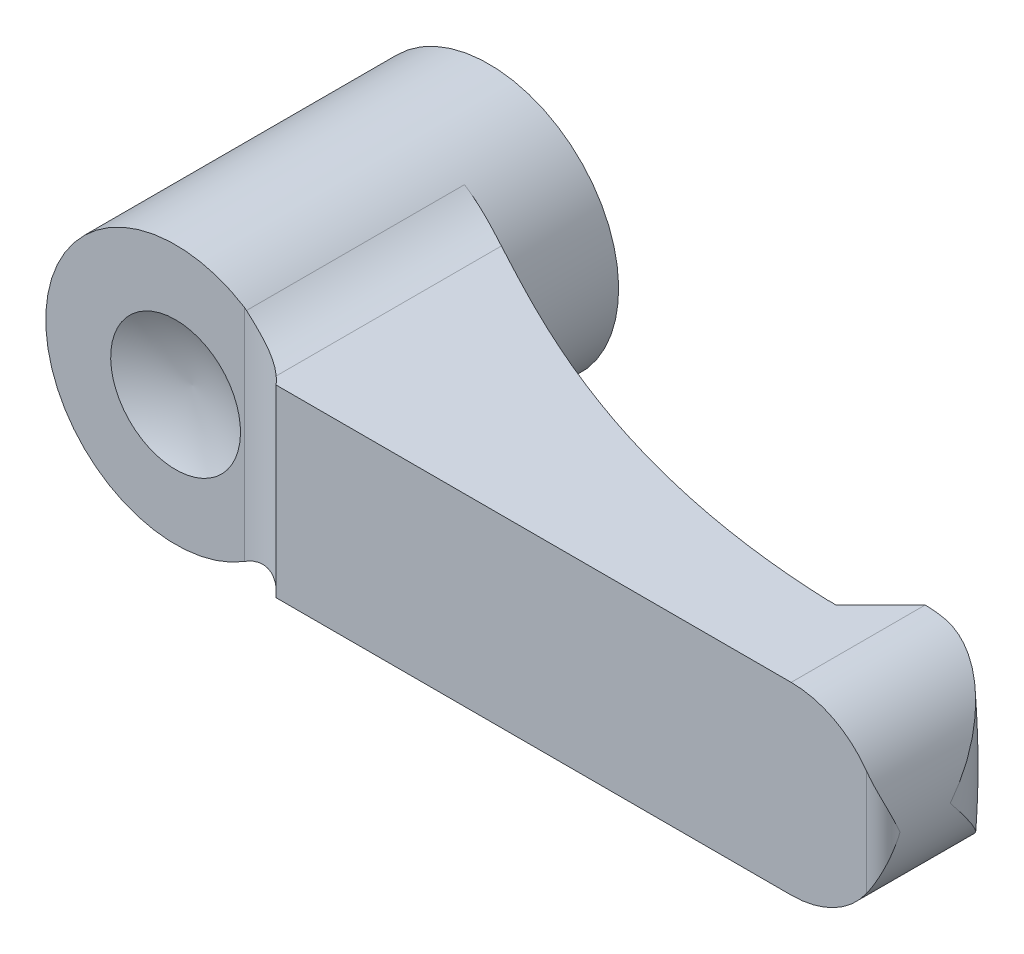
ISO-10303-21;
HEADER;
FILE_DESCRIPTION(('STEP AP214'),'2;1');
FILE_NAME('part.step','',(''),(''),'','','');
FILE_SCHEMA(('AUTOMOTIVE_DESIGN { 1 0 10303 214 1 1 1 1 }'));
ENDSEC;
DATA;
#1=APPLICATION_CONTEXT('core data for automotive mechanical design processes');
#2=APPLICATION_PROTOCOL_DEFINITION('international standard','automotive_design',2000,#1);
#3=PRODUCT_CONTEXT('',#1,'mechanical');
#4=PRODUCT('Part','Part','',(#3));
#5=PRODUCT_RELATED_PRODUCT_CATEGORY('part','',(#4));
#6=PRODUCT_DEFINITION_FORMATION('','',#4);
#7=PRODUCT_DEFINITION_CONTEXT('part definition',#1,'design');
#8=PRODUCT_DEFINITION('design','',#6,#7);
#9=PRODUCT_DEFINITION_SHAPE('','',#8);
#10=(LENGTH_UNIT() NAMED_UNIT(*) SI_UNIT(.MILLI.,.METRE.));
#11=(NAMED_UNIT(*) PLANE_ANGLE_UNIT() SI_UNIT($,.RADIAN.));
#12=(NAMED_UNIT(*) SI_UNIT($,.STERADIAN.) SOLID_ANGLE_UNIT());
#13=UNCERTAINTY_MEASURE_WITH_UNIT(LENGTH_MEASURE(1.E-05),#10,'distance_accuracy_value','');
#14=(GEOMETRIC_REPRESENTATION_CONTEXT(3) GLOBAL_UNCERTAINTY_ASSIGNED_CONTEXT((#13)) GLOBAL_UNIT_ASSIGNED_CONTEXT((#10,
#11,#12)) REPRESENTATION_CONTEXT('',''));
#15=CARTESIAN_POINT('',(0.,0.,0.));
#16=DIRECTION('',(0.,0.,1.));
#17=DIRECTION('',(1.,0.,0.));
#18=AXIS2_PLACEMENT_3D('',#15,#16,#17);
#19=CARTESIAN_POINT('',(38.5,0.,0.));
#20=DIRECTION('',(0.,0.,1.));
#21=DIRECTION('',(0.,-1.,0.));
#22=AXIS2_PLACEMENT_3D('',#19,#20,#21);
#23=CYLINDRICAL_SURFACE('',#22,5.5);
#24=CARTESIAN_POINT('',(44.0000000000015,0.,17.0000000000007));
#25=CARTESIAN_POINT('',(44.0000000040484,-0.00412943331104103,16.9967045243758));
#26=CARTESIAN_POINT('',(43.9999953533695,-0.0082589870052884,16.9934089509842));
#27=CARTESIAN_POINT('',(43.999112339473,-0.400108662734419,16.6806948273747));
#28=CARTESIAN_POINT('',(43.9572034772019,-0.788816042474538,16.37047941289));
#29=CARTESIAN_POINT('',(43.8318985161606,-1.36366951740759,15.9125326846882));
#30=CARTESIAN_POINT('',(43.7795708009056,-1.55425870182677,15.7608439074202));
#31=CARTESIAN_POINT('',(43.6535758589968,-1.93134753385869,15.4612161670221));
#32=CARTESIAN_POINT('',(43.5799185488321,-2.11784903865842,15.3132754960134));
#33=CARTESIAN_POINT('',(43.4309233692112,-2.44124807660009,15.0574517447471));
#34=CARTESIAN_POINT('',(43.3601738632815,-2.579369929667,14.9484282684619));
#35=CARTESIAN_POINT('',(43.2057353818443,-2.85141089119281,14.7343763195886));
#36=CARTESIAN_POINT('',(43.1220435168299,-2.98532905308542,14.6293487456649));
#37=CARTESIAN_POINT('',(42.8513917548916,-3.37883161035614,14.3221362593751));
#38=CARTESIAN_POINT('',(42.6444794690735,-3.63100011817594,14.1271576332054));
#39=CARTESIAN_POINT('',(42.2360437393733,-4.04393333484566,13.814214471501));
#40=CARTESIAN_POINT('',(42.0467235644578,-4.21156281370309,13.6893175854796));
#41=CARTESIAN_POINT('',(41.6377691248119,-4.52442928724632,13.46313419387));
#42=CARTESIAN_POINT('',(41.4181770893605,-4.6696968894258,13.3618153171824));
#43=CARTESIAN_POINT('',(41.0002622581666,-4.90337923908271,13.2094404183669));
#44=CARTESIAN_POINT('',(40.8073147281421,-4.99731688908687,13.1522808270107));
#45=CARTESIAN_POINT('',(40.5069684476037,-5.12190220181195,13.0853303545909));
#46=CARTESIAN_POINT('',(40.4049728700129,-5.1607273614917,13.0661396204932));
#47=CARTESIAN_POINT('',(40.1979126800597,-5.2325019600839,13.0346858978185));
#48=CARTESIAN_POINT('',(40.0928494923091,-5.26545407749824,13.022419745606));
#49=CARTESIAN_POINT('',(39.8792722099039,-5.32541434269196,13.0053554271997));
#50=CARTESIAN_POINT('',(39.7707338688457,-5.35235854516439,13.0006345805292));
#51=CARTESIAN_POINT('',(39.5522177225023,-5.39956667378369,12.999485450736));
#52=CARTESIAN_POINT('',(39.4422407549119,-5.41983432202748,13.0030525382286));
#53=CARTESIAN_POINT('',(39.2221294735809,-5.45352172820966,13.0189098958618));
#54=CARTESIAN_POINT('',(39.1119961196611,-5.46695729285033,13.0311798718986));
#55=CARTESIAN_POINT('',(38.8925476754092,-5.48707811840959,13.0647076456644));
#56=CARTESIAN_POINT('',(38.7832319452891,-5.49376936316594,13.0859574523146));
#57=CARTESIAN_POINT('',(38.64558011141,-5.49815186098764,13.1187159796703));
#58=CARTESIAN_POINT('',(38.6162880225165,-5.49884826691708,13.1260374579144));
#59=CARTESIAN_POINT('',(38.5579005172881,-5.49977248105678,13.1413372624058));
#60=CARTESIAN_POINT('',(38.5288049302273,-5.50000076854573,13.1493149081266));
#61=CARTESIAN_POINT('',(38.4998,-5.49999999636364,13.1576241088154));
#62=B_SPLINE_CURVE_WITH_KNOTS('',3,(#24,#25,#26,#27,#28,#29,#30,#31,#32,#33,#34,#35,#36,#37,#38,
#39,#40,#41,#42,#43,#44,#45,#46,#47,#48,#49,#50,#51,#52,#53,#54,#55,#56,#57,#58,#59,#60,#61),
.UNSPECIFIED.,.F.,.F.,(4,2,2,2,2,2,2,2,2,2,2,2,2,2,2,2,2,2,4),(0.,0.0158501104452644,
1.50396208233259,2.25074088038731,2.99717304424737,3.56562662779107,4.13420730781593,
5.26800636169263,6.11129803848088,6.95342500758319,7.61684533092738,7.94892228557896,
8.28084740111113,8.61615255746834,8.95127046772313,9.28560948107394,9.61965159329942,
9.71024817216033,9.80075194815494),.UNSPECIFIED.);
#63=CARTESIAN_POINT('',(39.6387096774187,-5.38083081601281,13.));
#64=VERTEX_POINT('',#63);
#65=CARTESIAN_POINT('',(44.,0.,17.));
#66=VERTEX_POINT('',#65);
#67=EDGE_CURVE('E382',#64,#66,#62,.F.);
#68=ORIENTED_EDGE('',*,*,#67,.T.);
#69=CARTESIAN_POINT('',(44.0000000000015,0.,17.0000000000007));
#70=CARTESIAN_POINT('',(44.0000000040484,0.00412943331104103,16.9967045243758));
#71=CARTESIAN_POINT('',(43.9999953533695,0.0082589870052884,16.9934089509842));
#72=CARTESIAN_POINT('',(43.999112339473,0.400108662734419,16.6806948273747));
#73=CARTESIAN_POINT('',(43.9572034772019,0.788816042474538,16.37047941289));
#74=CARTESIAN_POINT('',(43.8318985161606,1.36366951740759,15.9125326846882));
#75=CARTESIAN_POINT('',(43.7795708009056,1.55425870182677,15.7608439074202));
#76=CARTESIAN_POINT('',(43.6535758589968,1.93134753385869,15.4612161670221));
#77=CARTESIAN_POINT('',(43.5799185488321,2.11784903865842,15.3132754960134));
#78=CARTESIAN_POINT('',(43.4309233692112,2.44124807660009,15.0574517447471));
#79=CARTESIAN_POINT('',(43.3601738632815,2.579369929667,14.9484282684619));
#80=CARTESIAN_POINT('',(43.2057353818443,2.85141089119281,14.7343763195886));
#81=CARTESIAN_POINT('',(43.1220435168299,2.98532905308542,14.6293487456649));
#82=CARTESIAN_POINT('',(42.8513917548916,3.37883161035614,14.3221362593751));
#83=CARTESIAN_POINT('',(42.6444794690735,3.63100011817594,14.1271576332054));
#84=CARTESIAN_POINT('',(42.2360437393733,4.04393333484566,13.814214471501));
#85=CARTESIAN_POINT('',(42.0467235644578,4.21156281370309,13.6893175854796));
#86=CARTESIAN_POINT('',(41.6377691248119,4.52442928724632,13.46313419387));
#87=CARTESIAN_POINT('',(41.4181770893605,4.6696968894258,13.3618153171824));
#88=CARTESIAN_POINT('',(41.0002622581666,4.90337923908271,13.2094404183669));
#89=CARTESIAN_POINT('',(40.8073147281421,4.99731688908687,13.1522808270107));
#90=CARTESIAN_POINT('',(40.5069684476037,5.12190220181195,13.0853303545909));
#91=CARTESIAN_POINT('',(40.4049728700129,5.1607273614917,13.0661396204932));
#92=CARTESIAN_POINT('',(40.1979126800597,5.2325019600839,13.0346858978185));
#93=CARTESIAN_POINT('',(40.0928494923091,5.26545407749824,13.022419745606));
#94=CARTESIAN_POINT('',(39.8792722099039,5.32541434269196,13.0053554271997));
#95=CARTESIAN_POINT('',(39.7707338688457,5.35235854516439,13.0006345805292));
#96=CARTESIAN_POINT('',(39.5522177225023,5.39956667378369,12.999485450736));
#97=CARTESIAN_POINT('',(39.4422407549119,5.41983432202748,13.0030525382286));
#98=CARTESIAN_POINT('',(39.2221294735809,5.45352172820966,13.0189098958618));
#99=CARTESIAN_POINT('',(39.1119961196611,5.46695729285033,13.0311798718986));
#100=CARTESIAN_POINT('',(38.8925476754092,5.48707811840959,13.0647076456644));
#101=CARTESIAN_POINT('',(38.7832319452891,5.49376936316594,13.0859574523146));
#102=CARTESIAN_POINT('',(38.64558011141,5.49815186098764,13.1187159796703));
#103=CARTESIAN_POINT('',(38.6162880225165,5.49884826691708,13.1260374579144));
#104=CARTESIAN_POINT('',(38.5579005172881,5.49977248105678,13.1413372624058));
#105=CARTESIAN_POINT('',(38.5288049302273,5.50000076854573,13.1493149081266));
#106=CARTESIAN_POINT('',(38.4998,5.49999999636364,13.1576241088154));
#107=B_SPLINE_CURVE_WITH_KNOTS('',3,(#69,#70,#71,#72,#73,#74,#75,#76,#77,#78,#79,#80,#81,#82,
#83,#84,#85,#86,#87,#88,#89,#90,#91,#92,#93,#94,#95,#96,#97,#98,#99,#100,#101,#102,#103,#104,
#105,#106),.UNSPECIFIED.,.F.,.F.,(4,2,2,2,2,2,2,2,2,2,2,2,2,2,2,2,2,2,4),(0.,0.0158501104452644,
1.50396208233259,2.25074088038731,2.99717304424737,3.56562662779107,4.13420730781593,
5.26800636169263,6.11129803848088,6.95342500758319,7.61684533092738,7.94892228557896,
8.28084740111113,8.61615255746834,8.95127046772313,9.28560948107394,9.61965159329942,
9.71024817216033,9.80075194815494),.UNSPECIFIED.);
#108=CARTESIAN_POINT('',(39.6387096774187,5.38083081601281,13.));
#109=VERTEX_POINT('',#108);
#110=EDGE_CURVE('E165',#66,#109,#107,.T.);
#111=ORIENTED_EDGE('',*,*,#110,.T.);
#112=CARTESIAN_POINT('',(38.5,0.,13.));
#113=DIRECTION('',(0.,0.,-1.));
#114=DIRECTION('',(0.,1.,0.));
#115=AXIS2_PLACEMENT_3D('',#112,#113,#114);
#116=CIRCLE('',#115,5.5);
#117=CARTESIAN_POINT('',(38.5,5.5,13.));
#118=VERTEX_POINT('',#117);
#119=EDGE_CURVE('E364',#109,#118,#116,.F.);
#120=ORIENTED_EDGE('',*,*,#119,.T.);
#121=DIRECTION('',(0.,0.,1.));
#122=VECTOR('',#121,1.);
#123=CARTESIAN_POINT('',(38.5,5.5,0.));
#124=LINE('',#123,#122);
#125=CARTESIAN_POINT('',(38.5,5.5,21.));
#126=VERTEX_POINT('',#125);
#127=EDGE_CURVE('E334',#118,#126,#124,.T.);
#128=ORIENTED_EDGE('',*,*,#127,.T.);
#129=CARTESIAN_POINT('',(38.5,0.,21.));
#130=DIRECTION('',(0.,0.,1.));
#131=DIRECTION('',(0.,-1.,0.));
#132=AXIS2_PLACEMENT_3D('',#129,#130,#131);
#133=CIRCLE('',#132,5.5);
#134=CARTESIAN_POINT('',(43.,3.16227766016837,21.));
#135=VERTEX_POINT('',#134);
#136=EDGE_CURVE('E351',#135,#126,#133,.T.);
#137=ORIENTED_EDGE('',*,*,#136,.F.);
#138=CARTESIAN_POINT('',(43.,3.16227766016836,21.));
#139=CARTESIAN_POINT('',(43.0489698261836,3.09261080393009,20.9999556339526));
#140=CARTESIAN_POINT('',(43.0962528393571,3.02186876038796,20.9964077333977));
#141=CARTESIAN_POINT('',(43.187187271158,2.87878712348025,20.9834058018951));
#142=CARTESIAN_POINT('',(43.2308453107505,2.80645076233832,20.9739628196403));
#143=CARTESIAN_POINT('',(43.3141980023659,2.66092047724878,20.9503365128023));
#144=CARTESIAN_POINT('',(43.353915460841,2.58773460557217,20.9361828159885));
#145=CARTESIAN_POINT('',(43.4296865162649,2.44030003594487,20.9039171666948));
#146=CARTESIAN_POINT('',(43.4657377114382,2.3660506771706,20.8858026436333));
#147=CARTESIAN_POINT('',(43.5573559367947,2.16613298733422,20.8329178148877));
#148=CARTESIAN_POINT('',(43.6095944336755,2.0397138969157,20.7951786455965));
#149=CARTESIAN_POINT('',(43.7039555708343,1.78529411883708,20.7129945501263));
#150=CARTESIAN_POINT('',(43.7460735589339,1.65729273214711,20.668546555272));
#151=CARTESIAN_POINT('',(43.8205857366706,1.39978291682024,20.5746664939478));
#152=CARTESIAN_POINT('',(43.8529463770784,1.27027084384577,20.5252179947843));
#153=CARTESIAN_POINT('',(43.9079882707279,1.01058108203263,20.4229956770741));
#154=CARTESIAN_POINT('',(43.930673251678,0.880403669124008,20.3702231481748));
#155=CARTESIAN_POINT('',(43.9654953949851,0.627432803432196,20.2658240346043));
#156=CARTESIAN_POINT('',(43.978182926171,0.504664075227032,20.2143181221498));
#157=CARTESIAN_POINT('',(43.9952673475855,0.259135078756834,20.1104803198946));
#158=CARTESIAN_POINT('',(43.9996786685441,0.136375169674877,20.0581500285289));
#159=CARTESIAN_POINT('',(43.9999943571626,0.00909584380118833,20.0038784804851));
#160=CARTESIAN_POINT('',(43.9999999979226,0.00454789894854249,20.0019392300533));
#161=CARTESIAN_POINT('',(44.,0.,20.0000000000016));
#162=B_SPLINE_CURVE_WITH_KNOTS('',3,(#138,#139,#140,#141,#142,#143,#144,#145,#146,#147,#148,
#149,#150,#151,#152,#153,#154,#155,#156,#157,#158,#159,#160,#161),.UNSPECIFIED.,.F.,.F.,(4,2,2,
2,2,2,2,2,2,2,2,4),(0.,0.255244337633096,0.510011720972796,0.763206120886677,1.01656533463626,
1.44159949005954,1.86682865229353,2.29350365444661,2.72001412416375,3.12097942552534,
3.52124493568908,3.53607734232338),.UNSPECIFIED.);
#163=CARTESIAN_POINT('',(44.,0.,20.0000000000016));
#164=VERTEX_POINT('',#163);
#165=EDGE_CURVE('E175',#164,#135,#162,.F.);
#166=ORIENTED_EDGE('',*,*,#165,.F.);
#167=CARTESIAN_POINT('',(43.,-3.16227766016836,21.));
#168=CARTESIAN_POINT('',(43.0489698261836,-3.09261080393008,20.9999556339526));
#169=CARTESIAN_POINT('',(43.0962528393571,-3.02186876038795,20.9964077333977));
#170=CARTESIAN_POINT('',(43.1871872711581,-2.87878712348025,20.9834058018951));
#171=CARTESIAN_POINT('',(43.2308453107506,-2.80645076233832,20.9739628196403));
#172=CARTESIAN_POINT('',(43.3141980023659,-2.66092047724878,20.9503365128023));
#173=CARTESIAN_POINT('',(43.353915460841,-2.58773460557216,20.9361828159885));
#174=CARTESIAN_POINT('',(43.4296865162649,-2.44030003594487,20.9039171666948));
#175=CARTESIAN_POINT('',(43.4657377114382,-2.3660506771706,20.8858026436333));
#176=CARTESIAN_POINT('',(43.5573559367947,-2.16613298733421,20.8329178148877));
#177=CARTESIAN_POINT('',(43.6095944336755,-2.03971389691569,20.7951786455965));
#178=CARTESIAN_POINT('',(43.7039555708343,-1.78529411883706,20.7129945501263));
#179=CARTESIAN_POINT('',(43.7460735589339,-1.6572927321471,20.668546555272));
#180=CARTESIAN_POINT('',(43.8205857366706,-1.39978291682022,20.5746664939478));
#181=CARTESIAN_POINT('',(43.8529463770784,-1.27027084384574,20.5252179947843));
#182=CARTESIAN_POINT('',(43.9079882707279,-1.0105810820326,20.4229956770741));
#183=CARTESIAN_POINT('',(43.930673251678,-0.880403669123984,20.3702231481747));
#184=CARTESIAN_POINT('',(43.9654953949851,-0.627432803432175,20.2658240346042));
#185=CARTESIAN_POINT('',(43.978182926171,-0.504664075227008,20.2143181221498));
#186=CARTESIAN_POINT('',(43.9952673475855,-0.259135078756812,20.1104803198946));
#187=CARTESIAN_POINT('',(43.9996786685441,-0.136375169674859,20.0581500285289));
#188=CARTESIAN_POINT('',(43.9999943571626,-0.00909584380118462,20.0038784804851));
#189=CARTESIAN_POINT('',(43.9999999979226,-0.00454789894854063,20.0019392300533));
#190=CARTESIAN_POINT('',(44.,0.,20.0000000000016));
#191=B_SPLINE_CURVE_WITH_KNOTS('',3,(#167,#168,#169,#170,#171,#172,#173,#174,#175,#176,#177,
#178,#179,#180,#181,#182,#183,#184,#185,#186,#187,#188,#189,#190),.UNSPECIFIED.,.F.,.F.,(4,2,2,
2,2,2,2,2,2,2,2,4),(0.,0.2552443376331,0.510011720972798,0.76320612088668,1.01656533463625,
1.44159949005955,1.86682865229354,2.29350365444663,2.72001412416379,3.12097942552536,
3.52124493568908,3.53607734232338),.UNSPECIFIED.);
#192=CARTESIAN_POINT('',(43.,-3.16227766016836,21.));
#193=VERTEX_POINT('',#192);
#194=EDGE_CURVE('E22',#193,#164,#191,.T.);
#195=ORIENTED_EDGE('',*,*,#194,.F.);
#196=CARTESIAN_POINT('',(38.5,-5.5,21.));
#197=VERTEX_POINT('',#196);
#198=EDGE_CURVE('E352',#197,#193,#133,.T.);
#199=ORIENTED_EDGE('',*,*,#198,.F.);
#200=DIRECTION('',(0.,0.,1.));
#201=VECTOR('',#200,1.);
#202=CARTESIAN_POINT('',(38.5,-5.5,0.));
#203=LINE('',#202,#201);
#204=CARTESIAN_POINT('',(38.5,-5.5,13.));
#205=VERTEX_POINT('',#204);
#206=EDGE_CURVE('E340',#205,#197,#203,.T.);
#207=ORIENTED_EDGE('',*,*,#206,.F.);
#208=EDGE_CURVE('E186',#205,#64,#116,.F.);
#209=ORIENTED_EDGE('',*,*,#208,.T.);
#210=EDGE_LOOP('',(#68,#111,#120,#128,#137,#166,#195,#199,#207,#209));
#211=FACE_BOUND('',#210,.T.);
#212=ADVANCED_FACE('F14',(#211),#23,.T.);
#213=CARTESIAN_POINT('',(38.0113693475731,-11.,-36.28769945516));
#214=DIRECTION('',(0.,1.,0.));
#215=DIRECTION('',(-1.,0.,0.));
#216=AXIS2_PLACEMENT_3D('',#213,#214,#215);
#217=CYLINDRICAL_SURFACE('',#216,52.0000000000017);
#218=CARTESIAN_POINT('',(35.2526287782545,6.6002,15.6390696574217));
#219=CARTESIAN_POINT('',(35.3306710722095,6.15778148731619,15.6432089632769));
#220=CARTESIAN_POINT('',(35.4010151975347,5.71399671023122,15.6467763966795));
#221=CARTESIAN_POINT('',(35.5260850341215,4.8242127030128,15.6529153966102));
#222=CARTESIAN_POINT('',(35.5808102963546,4.37821340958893,15.6554869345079));
#223=CARTESIAN_POINT('',(35.6744349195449,3.48436157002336,15.6597826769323));
#224=CARTESIAN_POINT('',(35.7133278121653,3.03650834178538,15.661506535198));
#225=CARTESIAN_POINT('',(35.7751087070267,2.13972320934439,15.6642018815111));
#226=CARTESIAN_POINT('',(35.7979969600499,1.69079132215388,15.6651733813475));
#227=CARTESIAN_POINT('',(35.8421331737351,0.354195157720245,15.6670470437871));
#228=CARTESIAN_POINT('',(35.8400114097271,-0.534351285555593,15.6669575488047));
#229=CARTESIAN_POINT('',(35.7729034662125,-2.3086296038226,15.6641084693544));
#230=CARTESIAN_POINT('',(35.7079471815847,-3.19436261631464,15.6613501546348));
#231=CARTESIAN_POINT('',(35.566302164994,-4.49842899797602,15.6548034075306));
#232=CARTESIAN_POINT('',(35.5134242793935,-4.91947185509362,15.6523036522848));
#233=CARTESIAN_POINT('',(35.3935695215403,-5.76081148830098,15.6463998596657));
#234=CARTESIAN_POINT('',(35.3265514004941,-6.18110237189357,15.6429931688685));
#235=CARTESIAN_POINT('',(35.2526287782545,-6.6002,15.6390696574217));
#236=B_SPLINE_CURVE_WITH_KNOTS('',3,(#218,#219,#220,#221,#222,#223,#224,#225,#226,#227,#228,
#229,#230,#231,#232,#233,#234,#235),.UNSPECIFIED.,.F.,.F.,(4,2,2,2,2,2,2,2,4),(0.,
1.34773929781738,2.69551733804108,4.0438454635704,5.3921524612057,8.05541696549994,
10.7174149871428,11.9902864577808,13.2669236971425),.UNSPECIFIED.);
#237=CARTESIAN_POINT('',(35.4303781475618,5.5,15.6482080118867));
#238=VERTEX_POINT('',#237);
#239=CARTESIAN_POINT('',(35.833333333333,0.,15.666666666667));
#240=VERTEX_POINT('',#239);
#241=EDGE_CURVE('E291',#238,#240,#236,.T.);
#242=ORIENTED_EDGE('',*,*,#241,.F.);
#243=CARTESIAN_POINT('',(38.0113693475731,5.5,-36.28769945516));
#244=DIRECTION('',(0.,-1.,0.));
#245=DIRECTION('',(1.,0.,0.));
#246=AXIS2_PLACEMENT_3D('',#243,#244,#245);
#247=CIRCLE('',#246,52.0000000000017);
#248=CARTESIAN_POINT('',(35.833333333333,5.5,15.666666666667));
#249=VERTEX_POINT('',#248);
#250=EDGE_CURVE('E330',#238,#249,#247,.F.);
#251=ORIENTED_EDGE('',*,*,#250,.T.);
#252=DIRECTION('',(0.,1.,0.));
#253=VECTOR('',#252,1.);
#254=CARTESIAN_POINT('',(35.833333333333,-11.,15.666666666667));
#255=LINE('',#254,#253);
#256=EDGE_CURVE('E255',#240,#249,#255,.T.);
#257=ORIENTED_EDGE('',*,*,#256,.F.);
#258=EDGE_LOOP('',(#242,#251,#257));
#259=FACE_BOUND('',#258,.T.);
#260=ADVANCED_FACE('F141',(#259),#217,.F.);
#261=CARTESIAN_POINT('',(40.,-11.,13.));
#262=DIRECTION('',(0.,0.,-1.));
#263=DIRECTION('',(0.,1.,0.));
#264=AXIS2_PLACEMENT_3D('',#261,#262,#263);
#265=PLANE('',#264);
#266=ORIENTED_EDGE('',*,*,#119,.F.);
#267=CARTESIAN_POINT('',(-0.25,0.,13.));
#268=DIRECTION('',(0.,0.,-1.));
#269=DIRECTION('',(0.,1.,0.));
#270=AXIS2_PLACEMENT_3D('',#267,#268,#269);
#271=CIRCLE('',#270,40.2499999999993);
#272=EDGE_CURVE('E37',#109,#64,#271,.T.);
#273=ORIENTED_EDGE('',*,*,#272,.T.);
#274=ORIENTED_EDGE('',*,*,#208,.F.);
#275=DIRECTION('',(0.,1.,0.));
#276=VECTOR('',#275,1.);
#277=CARTESIAN_POINT('',(38.5,-11.,13.));
#278=LINE('',#277,#276);
#279=EDGE_CURVE('E325',#205,#118,#278,.T.);
#280=ORIENTED_EDGE('',*,*,#279,.T.);
#281=EDGE_LOOP('',(#266,#273,#274,#280));
#282=FACE_BOUND('',#281,.T.);
#283=ADVANCED_FACE('F148',(#282),#265,.T.);
#284=CARTESIAN_POINT('',(0.,0.,21.));
#285=DIRECTION('',(0.,0.,1.));
#286=DIRECTION('',(0.,-1.,0.));
#287=AXIS2_PLACEMENT_3D('',#284,#285,#286);
#288=PLANE('',#287);
#289=DIRECTION('',(1.,0.,0.));
#290=VECTOR('',#289,1.);
#291=CARTESIAN_POINT('',(7.2874067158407,5.5,21.));
#292=LINE('',#291,#290);
#293=CARTESIAN_POINT('',(7.75,5.5,21.));
#294=VERTEX_POINT('',#293);
#295=EDGE_CURVE('E329',#294,#126,#292,.T.);
#296=ORIENTED_EDGE('',*,*,#295,.F.);
#297=DIRECTION('',(0.,1.,0.));
#298=VECTOR('',#297,1.);
#299=CARTESIAN_POINT('',(7.75,-11.,21.));
#300=LINE('',#299,#298);
#301=CARTESIAN_POINT('',(7.75,-5.5,21.));
#302=VERTEX_POINT('',#301);
#303=EDGE_CURVE('E388',#302,#294,#300,.T.);
#304=ORIENTED_EDGE('',*,*,#303,.F.);
#305=DIRECTION('',(-1.,0.,0.));
#306=VECTOR('',#305,1.);
#307=CARTESIAN_POINT('',(38.5,-5.5,21.));
#308=LINE('',#307,#306);
#309=EDGE_CURVE('E409',#197,#302,#308,.T.);
#310=ORIENTED_EDGE('',*,*,#309,.F.);
#311=ORIENTED_EDGE('',*,*,#198,.T.);
#312=DIRECTION('',(0.,1.,0.));
#313=VECTOR('',#312,1.);
#314=CARTESIAN_POINT('',(43.,-11.,21.));
#315=LINE('',#314,#313);
#316=EDGE_CURVE('E361',#193,#135,#315,.T.);
#317=ORIENTED_EDGE('',*,*,#316,.T.);
#318=ORIENTED_EDGE('',*,*,#136,.T.);
#319=EDGE_LOOP('',(#296,#304,#310,#311,#317,#318));
#320=FACE_BOUND('',#319,.T.);
#321=ADVANCED_FACE('F243',(#320),#288,.T.);
#322=CARTESIAN_POINT('',(-0.25,0.,0.));
#323=DIRECTION('',(0.,0.,-1.));
#324=DIRECTION('',(0.,1.,0.));
#325=AXIS2_PLACEMENT_3D('',#322,#323,#324);
#326=CYLINDRICAL_SURFACE('',#325,7.75);
#327=CARTESIAN_POINT('',(-0.25,0.,0.3));
#328=DIRECTION('',(0.,0.,1.));
#329=DIRECTION('',(0.,-1.,0.));
#330=AXIS2_PLACEMENT_3D('',#327,#328,#329);
#331=CIRCLE('',#330,7.75);
#332=CARTESIAN_POINT('',(-0.25,-7.75,0.3));
#333=VERTEX_POINT('',#332);
#334=EDGE_CURVE('E9',#333,#333,#331,.T.);
#335=ORIENTED_EDGE('',*,*,#334,.T.);
#336=EDGE_LOOP('',(#335));
#337=FACE_BOUND('',#336,.T.);
#338=CARTESIAN_POINT('',(-0.25,0.,6.));
#339=DIRECTION('',(0.,0.,-1.));
#340=DIRECTION('',(0.,1.,0.));
#341=AXIS2_PLACEMENT_3D('',#338,#339,#340);
#342=CIRCLE('',#341,7.75);
#343=CARTESIAN_POINT('',(3.99835651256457,6.48181818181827,6.));
#344=VERTEX_POINT('',#343);
#345=CARTESIAN_POINT('',(3.99835651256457,-6.48181818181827,6.));
#346=VERTEX_POINT('',#345);
#347=EDGE_CURVE('E375',#344,#346,#342,.T.);
#348=ORIENTED_EDGE('',*,*,#347,.T.);
#349=DIRECTION('',(0.,0.,1.));
#350=VECTOR('',#349,1.);
#351=CARTESIAN_POINT('',(3.9983565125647,-6.4818181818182,0.));
#352=LINE('',#351,#350);
#353=CARTESIAN_POINT('',(3.9983565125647,-6.4818181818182,19.0142376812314));
#354=VERTEX_POINT('',#353);
#355=EDGE_CURVE('E412',#346,#354,#352,.T.);
#356=ORIENTED_EDGE('',*,*,#355,.T.);
#357=CARTESIAN_POINT('',(3.875,-6.56101173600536,19.));
#358=CARTESIAN_POINT('',(3.89570053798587,-6.54799679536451,19.0021736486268));
#359=CARTESIAN_POINT('',(3.91633051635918,-6.53488986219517,19.0044469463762));
#360=CARTESIAN_POINT('',(3.95744935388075,-6.50849201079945,19.00919284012));
#361=CARTESIAN_POINT('',(3.977938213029,-6.49520109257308,19.0116654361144));
#362=CARTESIAN_POINT('',(3.99835651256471,-6.48181818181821,19.0142376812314));
#363=B_SPLINE_CURVE_WITH_KNOTS('',3,(#357,#358,#359,#360,#361,#362),.UNSPECIFIED.,.F.,.F.,(4,2,
4),(0.,0.0736410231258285,0.147282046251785),.UNSPECIFIED.);
#364=CARTESIAN_POINT('',(3.875,-6.56101173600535,19.));
#365=VERTEX_POINT('',#364);
#366=EDGE_CURVE('E216',#365,#354,#363,.T.);
#367=ORIENTED_EDGE('',*,*,#366,.F.);
#368=CARTESIAN_POINT('',(-0.25,0.,19.));
#369=DIRECTION('',(0.,0.,-1.));
#370=DIRECTION('',(0.,1.,0.));
#371=AXIS2_PLACEMENT_3D('',#368,#369,#370);
#372=CIRCLE('',#371,7.75);
#373=CARTESIAN_POINT('',(3.875,6.56101173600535,19.));
#374=VERTEX_POINT('',#373);
#375=EDGE_CURVE('E349',#365,#374,#372,.T.);
#376=ORIENTED_EDGE('',*,*,#375,.T.);
#377=CARTESIAN_POINT('',(3.99835651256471,6.48181818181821,19.0142376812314));
#378=CARTESIAN_POINT('',(3.977938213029,6.49520109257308,19.0116654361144));
#379=CARTESIAN_POINT('',(3.95744935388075,6.50849201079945,19.00919284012));
#380=CARTESIAN_POINT('',(3.91633051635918,6.53488986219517,19.0044469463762));
#381=CARTESIAN_POINT('',(3.89570053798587,6.54799679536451,19.0021736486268));
#382=CARTESIAN_POINT('',(3.875,6.56101173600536,19.));
#383=B_SPLINE_CURVE_WITH_KNOTS('',3,(#377,#378,#379,#380,#381,#382),.UNSPECIFIED.,.F.,.F.,(4,2,
4),(0.,0.0736410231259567,0.147282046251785),.UNSPECIFIED.);
#384=CARTESIAN_POINT('',(3.9983565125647,6.4818181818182,19.0142376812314));
#385=VERTEX_POINT('',#384);
#386=EDGE_CURVE('E230',#385,#374,#383,.T.);
#387=ORIENTED_EDGE('',*,*,#386,.F.);
#388=DIRECTION('',(0.,0.,1.));
#389=VECTOR('',#388,1.);
#390=CARTESIAN_POINT('',(3.9983565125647,6.4818181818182,0.));
#391=LINE('',#390,#389);
#392=EDGE_CURVE('E342',#344,#385,#391,.T.);
#393=ORIENTED_EDGE('',*,*,#392,.F.);
#394=EDGE_LOOP('',(#348,#356,#367,#376,#387,#393));
#395=FACE_BOUND('',#394,.T.);
#396=ADVANCED_FACE('F241',(#337,#395),#326,.T.);
#397=CARTESIAN_POINT('',(7.28740671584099,11.5000000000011,0.));
#398=DIRECTION('',(0.,0.,1.));
#399=DIRECTION('',(0.,-1.,0.));
#400=AXIS2_PLACEMENT_3D('',#397,#398,#399);
#401=CYLINDRICAL_SURFACE('',#400,6.00000000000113);
#402=DIRECTION('',(0.,0.,1.));
#403=VECTOR('',#402,1.);
#404=CARTESIAN_POINT('',(7.28740671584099,5.5,0.));
#405=LINE('',#404,#403);
#406=CARTESIAN_POINT('',(7.28740671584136,5.5,7.08685738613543));
#407=VERTEX_POINT('',#406);
#408=CARTESIAN_POINT('',(7.28740671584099,5.5,20.5299560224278));
#409=VERTEX_POINT('',#408);
#410=EDGE_CURVE('E339',#407,#409,#405,.T.);
#411=ORIENTED_EDGE('',*,*,#410,.F.);
#412=CARTESIAN_POINT('',(7.28760671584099,5.50000000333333,7.08696413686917));
#413=CARTESIAN_POINT('',(7.15034044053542,5.50001326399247,7.01373970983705));
#414=CARTESIAN_POINT('',(7.01226219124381,5.50470337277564,6.94191829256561));
#415=CARTESIAN_POINT('',(6.73442352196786,5.52390552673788,6.80226274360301));
#416=CARTESIAN_POINT('',(6.59466016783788,5.53843827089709,6.73443734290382));
#417=CARTESIAN_POINT('',(6.31196481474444,5.57807947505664,6.60334347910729));
#418=CARTESIAN_POINT('',(6.1690160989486,5.60333637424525,6.54015416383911));
#419=CARTESIAN_POINT('',(5.88256013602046,5.66494278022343,6.42128538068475));
#420=CARTESIAN_POINT('',(5.73905348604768,5.70128257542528,6.36559939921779));
#421=CARTESIAN_POINT('',(5.3843070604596,5.80557517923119,6.23976759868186));
#422=CARTESIAN_POINT('',(5.17294146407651,5.88035833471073,6.1751312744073));
#423=CARTESIAN_POINT('',(4.85989295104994,6.01183658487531,6.09931612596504));
#424=CARTESIAN_POINT('',(4.75651283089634,6.05871150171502,6.07760127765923));
#425=CARTESIAN_POINT('',(4.55154846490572,6.15883414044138,6.04183297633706));
#426=CARTESIAN_POINT('',(4.44996313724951,6.21207786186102,6.02777474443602));
#427=CARTESIAN_POINT('',(4.29011865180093,6.30183274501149,6.01191660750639));
#428=CARTESIAN_POINT('',(4.23099705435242,6.33637230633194,6.00745749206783));
#429=CARTESIAN_POINT('',(4.11375451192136,6.4075890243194,6.00149177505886));
#430=CARTESIAN_POINT('',(4.05563561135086,6.4442700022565,5.99999062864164));
#431=CARTESIAN_POINT('',(3.99815651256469,6.48194927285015,6.00000000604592));
#432=B_SPLINE_CURVE_WITH_KNOTS('',3,(#412,#413,#414,#415,#416,#417,#418,#419,#420,#421,#422,
#423,#424,#425,#426,#427,#428,#429,#430,#431),.UNSPECIFIED.,.F.,.F.,(4,2,2,2,2,2,2,2,2,4),(0.,
0.466729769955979,0.934444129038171,1.40885500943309,1.88285136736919,2.57968337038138,
2.92603739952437,3.27217500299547,3.47793058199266,3.68406526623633),.UNSPECIFIED.);
#433=EDGE_CURVE('E247',#407,#344,#432,.T.);
#434=ORIENTED_EDGE('',*,*,#433,.T.);
#435=ORIENTED_EDGE('',*,*,#392,.T.);
#436=CARTESIAN_POINT('',(7.28740671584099,5.5,20.5299560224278));
#437=CARTESIAN_POINT('',(7.18976798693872,5.49999074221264,20.4410610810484));
#438=CARTESIAN_POINT('',(7.08914306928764,5.50238328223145,20.3553971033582));
#439=CARTESIAN_POINT('',(6.88258824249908,5.5127808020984,20.190963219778));
#440=CARTESIAN_POINT('',(6.77665505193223,5.52078929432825,20.1121976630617));
#441=CARTESIAN_POINT('',(6.56018652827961,5.54323878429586,19.9620438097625));
#442=CARTESIAN_POINT('',(6.44964749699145,5.55768504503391,19.890661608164));
#443=CARTESIAN_POINT('',(6.22500679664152,5.59371186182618,19.7557850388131));
#444=CARTESIAN_POINT('',(6.11090603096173,5.61529062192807,19.6922886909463));
#445=CARTESIAN_POINT('',(5.8796309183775,5.66628306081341,19.57319998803));
#446=CARTESIAN_POINT('',(5.76244453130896,5.69573352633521,19.5176466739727));
#447=CARTESIAN_POINT('',(5.52672984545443,5.76283779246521,19.4149858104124));
#448=CARTESIAN_POINT('',(5.40820160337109,5.80049124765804,19.3678779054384));
#449=CARTESIAN_POINT('',(5.17131671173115,5.88413792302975,19.2821934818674));
#450=CARTESIAN_POINT('',(5.0529602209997,5.93011355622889,19.2435993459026));
#451=CARTESIAN_POINT('',(4.81747871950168,6.03046342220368,19.1746316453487));
#452=CARTESIAN_POINT('',(4.70035321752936,6.08483415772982,19.1442546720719));
#453=CARTESIAN_POINT('',(4.48447551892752,6.19376729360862,19.0949614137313));
#454=CARTESIAN_POINT('',(4.38541438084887,6.24727213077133,19.075042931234));
#455=CARTESIAN_POINT('',(4.18983278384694,6.36017262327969,19.0406557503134));
#456=CARTESIAN_POINT('',(4.09331045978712,6.41956379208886,19.0261829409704));
#457=CARTESIAN_POINT('',(3.9983565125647,6.4818181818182,19.0142376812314));
#458=B_SPLINE_CURVE_WITH_KNOTS('',3,(#436,#437,#438,#439,#440,#441,#442,#443,#444,#445,#446,
#447,#448,#449,#450,#451,#452,#453,#454,#455,#456,#457),.UNSPECIFIED.,.F.,.F.,(4,2,2,2,2,2,2,2,
2,2,4),(0.,0.39608789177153,0.792423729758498,1.18908417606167,1.58564481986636,
1.98409212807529,2.38252266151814,2.78012083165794,3.17755381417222,3.52025420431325,
3.86269536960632),.UNSPECIFIED.);
#459=EDGE_CURVE('E224',#409,#385,#458,.T.);
#460=ORIENTED_EDGE('',*,*,#459,.F.);
#461=EDGE_LOOP('',(#411,#434,#435,#460));
#462=FACE_BOUND('',#461,.T.);
#463=ADVANCED_FACE('F237',(#462),#401,.F.);
#464=CARTESIAN_POINT('',(7.2874067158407,5.5,0.));
#465=DIRECTION('',(0.,-1.,0.));
#466=DIRECTION('',(1.,0.,0.));
#467=AXIS2_PLACEMENT_3D('',#464,#465,#466);
#468=PLANE('',#467);
#469=ORIENTED_EDGE('',*,*,#250,.F.);
#470=CARTESIAN_POINT('',(65.8628272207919,5.5,-14.5912083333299));
#471=CARTESIAN_POINT('',(64.6062311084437,5.5,-13.3389397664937));
#472=CARTESIAN_POINT('',(63.3495145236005,5.5,-12.0867921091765));
#473=CARTESIAN_POINT('',(60.8357878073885,5.5,-9.58279132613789));
#474=CARTESIAN_POINT('',(59.578777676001,5.5,-8.3309382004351));
#475=CARTESIAN_POINT('',(55.80745802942,5.5,-4.57612865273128));
#476=CARTESIAN_POINT('',(53.2926296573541,5.5,-2.07369320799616));
#477=CARTESIAN_POINT('',(49.5191301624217,5.5,1.67806766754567));
#478=CARTESIAN_POINT('',(48.2612446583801,5.5,2.92818326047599));
#479=CARTESIAN_POINT('',(45.7448127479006,5.5,5.42774237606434));
#480=CARTESIAN_POINT('',(44.4862663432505,5.5,6.67718590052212));
#481=CARTESIAN_POINT('',(41.96821820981,5.5,9.17532478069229));
#482=CARTESIAN_POINT('',(40.7087164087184,5.5,10.4240200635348));
#483=CARTESIAN_POINT('',(38.188591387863,5.5,12.9203033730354));
#484=CARTESIAN_POINT('',(36.9279681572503,5.5,14.1678913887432));
#485=CARTESIAN_POINT('',(34.4045793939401,5.5,16.6622050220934));
#486=CARTESIAN_POINT('',(33.1418130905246,5.5,17.9089298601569));
#487=CARTESIAN_POINT('',(30.6142644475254,5.5,20.4002463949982));
#488=CARTESIAN_POINT('',(29.3494821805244,5.5,21.6448381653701));
#489=CARTESIAN_POINT('',(27.4502363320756,5.5,23.5092721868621));
#490=CARTESIAN_POINT('',(26.8168948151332,5.5,24.1302573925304));
#491=CARTESIAN_POINT('',(25.5492906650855,5.5,25.3712836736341));
#492=CARTESIAN_POINT('',(24.9150280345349,5.5,25.9913247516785));
#493=CARTESIAN_POINT('',(23.6452809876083,5.5,27.230310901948));
#494=CARTESIAN_POINT('',(23.0097964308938,5.5,27.8492558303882));
#495=CARTESIAN_POINT('',(21.7373754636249,5.5,29.0856653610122));
#496=CARTESIAN_POINT('',(21.1004390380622,5.5,29.7031299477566));
#497=CARTESIAN_POINT('',(19.8241005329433,5.5,30.9367198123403));
#498=CARTESIAN_POINT('',(19.1846966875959,5.5,31.5528432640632));
#499=CARTESIAN_POINT('',(17.903457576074,5.5,32.7825127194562));
#500=CARTESIAN_POINT('',(17.2616223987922,5.5,33.3960588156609));
#501=CARTESIAN_POINT('',(15.9748932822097,5.5,34.6194024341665));
#502=CARTESIAN_POINT('',(15.3300007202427,5.5,35.2292014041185));
#503=CARTESIAN_POINT('',(14.0354963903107,5.5,36.4439558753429));
#504=CARTESIAN_POINT('',(13.3858840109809,5.5,37.0489107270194));
#505=CARTESIAN_POINT('',(12.4058813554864,5.5,37.9512586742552));
#506=CARTESIAN_POINT('',(12.0780367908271,5.5,38.2514156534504));
#507=CARTESIAN_POINT('',(11.4202356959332,5.5,38.8493971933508));
#508=CARTESIAN_POINT('',(11.0902792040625,5.5,39.1472217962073));
#509=CARTESIAN_POINT('',(10.4278534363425,5.5,39.7398107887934));
#510=CARTESIAN_POINT('',(10.0953851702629,5.5,40.0345763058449));
#511=CARTESIAN_POINT('',(9.42707634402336,5.5,40.6203155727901));
#512=CARTESIAN_POINT('',(9.09123554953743,5.5,40.9112890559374));
#513=CARTESIAN_POINT('',(8.41465839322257,5.5,41.4886584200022));
#514=CARTESIAN_POINT('',(8.07391475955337,5.5,41.7750457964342));
#515=CARTESIAN_POINT('',(7.38676622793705,5.5,42.3408540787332));
#516=CARTESIAN_POINT('',(7.0403624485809,5.5,42.6202763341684));
#517=CARTESIAN_POINT('',(6.51472876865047,5.5,43.0322142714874));
#518=CARTESIAN_POINT('',(6.33839027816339,5.5,43.1684183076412));
#519=CARTESIAN_POINT('',(5.98344016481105,5.5,43.4378155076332));
#520=CARTESIAN_POINT('',(5.80482867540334,5.5,43.5710088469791));
#521=CARTESIAN_POINT('',(5.44481305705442,5.5,43.8338340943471));
#522=CARTESIAN_POINT('',(5.26340717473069,5.5,43.9634636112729));
#523=CARTESIAN_POINT('',(4.89737784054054,5.5,44.2181703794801));
#524=CARTESIAN_POINT('',(4.7127537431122,5.5,44.3432467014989));
#525=CARTESIAN_POINT('',(4.526287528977,5.5,44.4655698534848));
#526=B_SPLINE_CURVE_WITH_KNOTS('',3,(#470,#471,#472,#473,#474,#475,#476,#477,#478,#479,#480,
#481,#482,#483,#484,#485,#486,#487,#488,#489,#490,#491,#492,#493,#494,#495,#496,#497,#498,#499,
#500,#501,#502,#503,#504,#505,#506,#507,#508,#509,#510,#511,#512,#513,#514,#515,#516,#517,#518,
#519,#520,#521,#522,#523,#524,#525),.UNSPECIFIED.,.F.,.F.,(4,2,2,2,2,2,2,2,2,2,2,2,2,2,2,2,2,2,
2,2,2,2,2,2,2,2,2,4),(0.,5.32211355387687,10.6442274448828,21.2874826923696,26.6077817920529,
31.9280665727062,37.2488049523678,42.5695953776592,47.893137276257,53.2164916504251,
55.8774488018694,58.5383985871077,61.1996748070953,63.8609786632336,66.5248070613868,
69.1885389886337,71.8511673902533,74.5141470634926,75.8476252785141,77.1810793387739,
78.514023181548,79.8470602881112,81.1823351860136,82.5173493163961,83.18577075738,
83.8541531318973,84.5229735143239,85.1919296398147),.UNSPECIFIED.);
#527=CARTESIAN_POINT('',(35.4117013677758,5.5,15.666666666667));
#528=VERTEX_POINT('',#527);
#529=EDGE_CURVE('E287',#238,#528,#526,.T.);
#530=ORIENTED_EDGE('',*,*,#529,.T.);
#531=CARTESIAN_POINT('',(20.8336351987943,5.5,13.1115367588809));
#532=CARTESIAN_POINT('',(19.8629415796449,5.5,12.8034242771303));
#533=CARTESIAN_POINT('',(18.9003071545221,5.5,12.4695099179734));
#534=CARTESIAN_POINT('',(17.4700212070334,5.5,11.9325422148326));
#535=CARTESIAN_POINT('',(16.9954797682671,5.5,11.7475121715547));
#536=CARTESIAN_POINT('',(16.051022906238,5.5,11.3659729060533));
#537=CARTESIAN_POINT('',(15.581107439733,5.5,11.169463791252));
#538=CARTESIAN_POINT('',(14.6458087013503,5.5,10.7655875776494));
#539=CARTESIAN_POINT('',(14.1804268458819,5.5,10.5582172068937));
#540=CARTESIAN_POINT('',(13.2542207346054,5.5,10.1335318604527));
#541=CARTESIAN_POINT('',(12.7933965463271,5.5,9.91621673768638));
#542=CARTESIAN_POINT('',(11.8760506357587,5.5,9.47278051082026));
#543=CARTESIAN_POINT('',(11.4195286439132,5.5,9.24665996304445));
#544=CARTESIAN_POINT('',(10.510185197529,5.5,8.78711532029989));
#545=CARTESIAN_POINT('',(10.057363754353,5.5,8.55369120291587));
#546=CARTESIAN_POINT('',(9.16175609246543,5.5,8.08547142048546));
#547=CARTESIAN_POINT('',(8.71892608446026,5.5,7.85075912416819));
#548=CARTESIAN_POINT('',(8.05546653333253,5.5,7.49718004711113));
#549=CARTESIAN_POINT('',(7.83443463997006,5.5,7.37906339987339));
#550=CARTESIAN_POINT('',(7.39235344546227,5.5,7.14286291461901));
#551=CARTESIAN_POINT('',(7.17130414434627,5.5,7.02477907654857));
#552=CARTESIAN_POINT('',(6.72840389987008,5.5,6.78905504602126));
#553=CARTESIAN_POINT('',(6.5065522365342,5.5,6.67141620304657));
#554=CARTESIAN_POINT('',(6.06205021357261,5.5,6.43765871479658));
#555=CARTESIAN_POINT('',(5.83939986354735,5.5,6.32154005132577));
#556=CARTESIAN_POINT('',(5.39279363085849,5.5,6.09192815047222));
#557=CARTESIAN_POINT('',(5.1688379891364,5.5,5.97843444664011));
#558=CARTESIAN_POINT('',(4.71892954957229,5.5,5.75549005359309));
#559=CARTESIAN_POINT('',(4.49297687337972,5.5,5.64603912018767));
#560=CARTESIAN_POINT('',(4.01827583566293,5.5,5.4236999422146));
#561=CARTESIAN_POINT('',(3.76927017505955,5.5,5.31135581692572));
#562=CARTESIAN_POINT('',(3.26674862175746,5.5,5.09695349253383));
#563=CARTESIAN_POINT('',(3.01323181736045,5.5,4.99489740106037));
#564=CARTESIAN_POINT('',(2.50158702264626,5.5,4.80587546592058));
#565=CARTESIAN_POINT('',(2.24347912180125,5.5,4.71885616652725));
#566=CARTESIAN_POINT('',(1.72125255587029,5.5,4.56507665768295));
#567=CARTESIAN_POINT('',(1.45713701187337,5.5,4.49830617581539));
#568=CARTESIAN_POINT('',(0.983686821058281,5.5,4.40318800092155));
#569=CARTESIAN_POINT('',(0.775423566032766,5.5,4.36957202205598));
#570=CARTESIAN_POINT('',(0.356756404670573,5.5,4.32054205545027));
#571=CARTESIAN_POINT('',(0.146353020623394,5.5,4.30512372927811));
#572=CARTESIAN_POINT('',(-0.274454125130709,5.5,4.29376015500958));
#573=CARTESIAN_POINT('',(-0.484856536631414,5.5,4.2977656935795));
#574=CARTESIAN_POINT('',(-0.904457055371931,5.5,4.32480514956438));
#575=CARTESIAN_POINT('',(-1.11365491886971,5.5,4.34784279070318));
#576=CARTESIAN_POINT('',(-1.46855925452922,5.5,4.4018737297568));
#577=CARTESIAN_POINT('',(-1.61494566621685,5.5,4.42857149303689));
#578=CARTESIAN_POINT('',(-1.90611080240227,5.5,4.48967044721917));
#579=CARTESIAN_POINT('',(-2.05088928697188,5.5,4.52407277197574));
#580=CARTESIAN_POINT('',(-2.48272333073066,5.5,4.63738447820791));
#581=CARTESIAN_POINT('',(-2.7671493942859,5.5,4.72637745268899));
#582=CARTESIAN_POINT('',(-3.18997385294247,5.5,4.87475835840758));
#583=CARTESIAN_POINT('',(-3.33100170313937,5.5,4.92701136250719));
#584=CARTESIAN_POINT('',(-3.61148930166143,5.5,5.03560386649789));
#585=CARTESIAN_POINT('',(-3.75094903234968,5.5,5.09194341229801));
#586=CARTESIAN_POINT('',(-4.0284177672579,5.5,5.20795322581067));
#587=CARTESIAN_POINT('',(-4.16642717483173,5.5,5.26762253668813));
#588=CARTESIAN_POINT('',(-4.44122438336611,5.5,5.3896849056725));
#589=CARTESIAN_POINT('',(-4.57801224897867,5.5,5.45207781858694));
#590=CARTESIAN_POINT('',(-4.8717370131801,5.5,5.58892857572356));
#591=CARTESIAN_POINT('',(-5.02850187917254,5.5,5.66375461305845));
#592=CARTESIAN_POINT('',(-5.34093187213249,5.5,5.81567273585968));
#593=CARTESIAN_POINT('',(-5.49659696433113,5.5,5.89276489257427));
#594=CARTESIAN_POINT('',(-5.96235171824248,5.5,6.12660382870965));
#595=CARTESIAN_POINT('',(-6.27116097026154,5.5,6.28589412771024));
#596=CARTESIAN_POINT('',(-6.88711023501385,5.5,6.60798778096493));
#597=CARTESIAN_POINT('',(-7.19424937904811,5.5,6.7707927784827));
#598=CARTESIAN_POINT('',(-7.80787858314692,5.5,7.09756746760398));
#599=CARTESIAN_POINT('',(-8.11436868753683,5.5,7.26153707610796));
#600=CARTESIAN_POINT('',(-8.72780920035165,5.5,7.58914332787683));
#601=CARTESIAN_POINT('',(-9.03475978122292,5.5,7.752779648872));
#602=CARTESIAN_POINT('',(-9.6495357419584,5.5,8.07841553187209));
#603=CARTESIAN_POINT('',(-9.95736113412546,5.5,8.24041507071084));
#604=CARTESIAN_POINT('',(-10.5742600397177,5.5,8.56183999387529));
#605=CARTESIAN_POINT('',(-10.8833332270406,5.5,8.72126600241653));
#606=CARTESIAN_POINT('',(-11.503117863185,5.5,9.03689999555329));
#607=CARTESIAN_POINT('',(-11.8138293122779,5.5,9.1931079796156));
#608=CARTESIAN_POINT('',(-12.7437695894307,5.5,9.65358584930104));
#609=CARTESIAN_POINT('',(-13.3657628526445,5.5,9.95231592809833));
#610=CARTESIAN_POINT('',(-14.6181321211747,5.5,10.5318094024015));
#611=CARTESIAN_POINT('',(-15.2485086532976,5.5,10.8125716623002));
#612=CARTESIAN_POINT('',(-16.5179981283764,5.5,11.3540613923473));
#613=CARTESIAN_POINT('',(-17.1571130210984,5.5,11.6147843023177));
#614=CARTESIAN_POINT('',(-18.4437614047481,5.5,12.114553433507));
#615=CARTESIAN_POINT('',(-19.0912947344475,5.5,12.3536000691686));
#616=CARTESIAN_POINT('',(-20.4038784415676,5.5,12.8121574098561));
#617=CARTESIAN_POINT('',(-21.0690465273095,5.5,13.0313317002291));
#618=CARTESIAN_POINT('',(-22.4069750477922,5.5,13.4451685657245));
#619=CARTESIAN_POINT('',(-23.0797355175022,5.5,13.6398310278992));
#620=CARTESIAN_POINT('',(-24.431942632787,5.5,14.0038273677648));
#621=CARTESIAN_POINT('',(-25.1113879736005,5.5,14.1731660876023));
#622=CARTESIAN_POINT('',(-26.4762660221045,5.5,14.4859387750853));
#623=CARTESIAN_POINT('',(-27.1616991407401,5.5,14.6293709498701));
#624=CARTESIAN_POINT('',(-28.5423255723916,5.5,14.890701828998));
#625=CARTESIAN_POINT('',(-29.2375535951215,5.5,15.0084177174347));
#626=CARTESIAN_POINT('',(-30.6320869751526,5.5,15.2166400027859));
#627=CARTESIAN_POINT('',(-31.3313926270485,5.5,15.3071444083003));
#628=CARTESIAN_POINT('',(-33.4339828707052,5.5,15.5373168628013));
#629=CARTESIAN_POINT('',(-34.842019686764,5.5,15.6356591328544));
#630=CARTESIAN_POINT('',(-37.8050391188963,5.5,15.7245579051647));
#631=CARTESIAN_POINT('',(-39.3603820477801,5.5,15.7031163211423));
#632=CARTESIAN_POINT('',(-42.4632306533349,5.5,15.5233289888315));
#633=CARTESIAN_POINT('',(-44.0107360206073,5.5,15.3649778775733));
#634=CARTESIAN_POINT('',(-47.0817973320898,5.5,14.9125053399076));
#635=CARTESIAN_POINT('',(-48.6054037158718,5.5,14.6187263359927));
#636=CARTESIAN_POINT('',(-51.6205738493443,5.5,13.8973618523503));
#637=CARTESIAN_POINT('',(-53.1121389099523,5.5,13.4697818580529));
#638=CARTESIAN_POINT('',(-55.9858032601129,5.5,12.5058831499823));
#639=CARTESIAN_POINT('',(-57.3698177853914,5.5,11.975264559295));
#640=CARTESIAN_POINT('',(-60.087723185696,5.5,10.798331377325));
#641=CARTESIAN_POINT('',(-61.4216156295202,5.5,10.1520204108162));
#642=CARTESIAN_POINT('',(-64.0304849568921,5.5,8.74773048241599));
#643=CARTESIAN_POINT('',(-65.3054193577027,5.5,7.98967259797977));
#644=CARTESIAN_POINT('',(-67.786033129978,5.5,6.3676242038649));
#645=CARTESIAN_POINT('',(-68.9917123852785,5.5,5.50363351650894));
#646=CARTESIAN_POINT('',(-71.3129296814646,5.5,3.68536411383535));
#647=CARTESIAN_POINT('',(-72.4292685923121,5.5,2.7321075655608));
#648=CARTESIAN_POINT('',(-74.5774053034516,5.5,0.734685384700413));
#649=CARTESIAN_POINT('',(-75.6092039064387,5.5,-0.309479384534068));
#650=CARTESIAN_POINT('',(-77.5805905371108,5.5,-2.48102216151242));
#651=CARTESIAN_POINT('',(-78.5202016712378,5.5,-3.60837919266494));
#652=CARTESIAN_POINT('',(-80.3007440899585,5.5,-5.93850218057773));
#653=CARTESIAN_POINT('',(-81.1416753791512,5.5,-7.1412681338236));
#654=CARTESIAN_POINT('',(-82.7163345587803,5.5,-9.60974981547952));
#655=CARTESIAN_POINT('',(-83.4503890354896,5.5,-10.8752572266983));
#656=CARTESIAN_POINT('',(-84.8091555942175,5.5,-13.4636686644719));
#657=CARTESIAN_POINT('',(-85.4338679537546,5.5,-14.7865725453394));
#658=CARTESIAN_POINT('',(-86.5695095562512,5.5,-17.4804399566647));
#659=CARTESIAN_POINT('',(-87.0804321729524,5.5,-18.8514062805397));
#660=CARTESIAN_POINT('',(-87.9847870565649,5.5,-21.631558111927));
#661=CARTESIAN_POINT('',(-88.3782193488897,5.5,-23.0407436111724));
#662=CARTESIAN_POINT('',(-89.0443414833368,5.5,-25.8854394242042));
#663=CARTESIAN_POINT('',(-89.3171872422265,5.5,-27.3209132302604));
#664=CARTESIAN_POINT('',(-89.7409303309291,5.5,-30.209747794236));
#665=CARTESIAN_POINT('',(-89.8918277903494,5.5,-31.6631085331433));
#666=CARTESIAN_POINT('',(-90.07059400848,5.5,-34.5773488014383));
#667=CARTESIAN_POINT('',(-90.0984651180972,5.5,-36.0382281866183));
#668=CARTESIAN_POINT('',(-90.030985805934,5.5,-38.9571384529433));
#669=CARTESIAN_POINT('',(-89.935635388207,5.5,-40.4151693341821));
#670=CARTESIAN_POINT('',(-89.6224601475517,5.5,-43.3174022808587));
#671=CARTESIAN_POINT('',(-89.4046863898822,5.5,-44.7616098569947));
#672=CARTESIAN_POINT('',(-88.8482570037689,5.5,-47.6265465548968));
#673=CARTESIAN_POINT('',(-88.5096014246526,5.5,-49.0472756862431));
#674=CARTESIAN_POINT('',(-87.7138251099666,5.5,-51.8551675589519));
#675=CARTESIAN_POINT('',(-87.2567037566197,5.5,-53.2423301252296));
#676=CARTESIAN_POINT('',(-86.2272611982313,5.5,-55.9732291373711));
#677=CARTESIAN_POINT('',(-85.6549399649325,5.5,-57.3169655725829));
#678=CARTESIAN_POINT('',(-84.3990845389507,5.5,-59.9516837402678));
#679=CARTESIAN_POINT('',(-83.7155327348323,5.5,-61.2426570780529));
#680=CARTESIAN_POINT('',(-82.2421617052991,5.5,-63.7624662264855));
#681=CARTESIAN_POINT('',(-81.4523424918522,5.5,-64.9913020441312));
#682=CARTESIAN_POINT('',(-79.7720842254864,5.5,-67.3781179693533));
#683=CARTESIAN_POINT('',(-78.8816463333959,5.5,-68.5360988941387));
#684=CARTESIAN_POINT('',(-77.0064965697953,5.5,-70.7730328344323));
#685=CARTESIAN_POINT('',(-76.0217846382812,5.5,-71.8519857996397));
#686=CARTESIAN_POINT('',(-73.9642694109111,5.5,-73.924098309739));
#687=CARTESIAN_POINT('',(-72.891394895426,5.5,-74.9171871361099));
#688=CARTESIAN_POINT('',(-70.6659102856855,5.5,-76.809591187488));
#689=CARTESIAN_POINT('',(-69.513300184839,5.5,-77.7089064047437));
#690=CARTESIAN_POINT('',(-67.1365250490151,5.5,-79.4074897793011));
#691=CARTESIAN_POINT('',(-65.9123576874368,5.5,-80.2067546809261));
#692=CARTESIAN_POINT('',(-63.4012212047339,5.5,-81.699643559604));
#693=CARTESIAN_POINT('',(-62.1142519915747,5.5,-82.3932673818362));
#694=CARTESIAN_POINT('',(-59.4838875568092,5.5,-83.6714509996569));
#695=CARTESIAN_POINT('',(-58.140378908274,5.5,-84.2557773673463));
#696=CARTESIAN_POINT('',(-55.4090576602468,5.5,-85.3095867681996));
#697=CARTESIAN_POINT('',(-54.0212450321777,5.5,-85.7790697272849));
#698=CARTESIAN_POINT('',(-51.2113097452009,5.5,-86.6000753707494));
#699=CARTESIAN_POINT('',(-49.7891903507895,5.5,-86.9516092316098));
#700=CARTESIAN_POINT('',(-46.9205533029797,5.5,-87.5346251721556));
#701=CARTESIAN_POINT('',(-45.4740356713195,5.5,-87.7661073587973));
#702=CARTESIAN_POINT('',(-42.5588905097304,5.5,-88.1087845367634));
#703=CARTESIAN_POINT('',(-41.0901854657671,5.5,-88.2193174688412));
#704=CARTESIAN_POINT('',(-38.1484765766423,5.5,-88.3176761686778));
#705=CARTESIAN_POINT('',(-36.6754726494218,5.5,-88.3054995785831));
#706=CARTESIAN_POINT('',(-34.4708067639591,5.5,-88.1960299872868));
#707=CARTESIAN_POINT('',(-33.7366004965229,5.5,-88.1443228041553));
#708=CARTESIAN_POINT('',(-32.2709487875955,5.5,-88.0107595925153));
#709=CARTESIAN_POINT('',(-31.5395031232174,5.5,-87.9289060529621));
#710=CARTESIAN_POINT('',(-30.0806186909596,5.5,-87.7353876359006));
#711=CARTESIAN_POINT('',(-29.3531797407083,5.5,-87.6237241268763));
#712=CARTESIAN_POINT('',(-27.9034355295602,5.5,-87.3710224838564));
#713=CARTESIAN_POINT('',(-27.181130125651,5.5,-87.2299851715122));
#714=CARTESIAN_POINT('',(-25.8676241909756,5.5,-86.946079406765));
#715=CARTESIAN_POINT('',(-25.2754307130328,5.5,-86.8077787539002));
#716=CARTESIAN_POINT('',(-24.0958872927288,5.5,-86.5118774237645));
#717=CARTESIAN_POINT('',(-23.508537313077,5.5,-86.354276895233));
#718=CARTESIAN_POINT('',(-22.3393128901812,5.5,-86.0202583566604));
#719=CARTESIAN_POINT('',(-21.7574376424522,5.5,-85.8438431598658));
#720=CARTESIAN_POINT('',(-20.5995489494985,5.5,-85.4727262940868));
#721=CARTESIAN_POINT('',(-20.0235355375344,5.5,-85.2780245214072));
#722=CARTESIAN_POINT('',(-18.8791575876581,5.5,-84.8715006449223));
#723=CARTESIAN_POINT('',(-18.3107779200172,5.5,-84.6597210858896));
#724=CARTESIAN_POINT('',(-17.1805244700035,5.5,-84.2194590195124));
#725=CARTESIAN_POINT('',(-16.6186507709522,5.5,-83.9909762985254));
#726=CARTESIAN_POINT('',(-15.5015651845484,5.5,-83.5183764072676));
#727=CARTESIAN_POINT('',(-14.9463529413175,5.5,-83.2742600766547));
#728=CARTESIAN_POINT('',(-13.8424455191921,5.5,-82.7717506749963));
#729=CARTESIAN_POINT('',(-13.2937502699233,5.5,-82.5133577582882));
#730=CARTESIAN_POINT('',(-12.4262210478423,5.5,-82.0927265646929));
#731=CARTESIAN_POINT('',(-12.1054200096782,5.5,-81.9345219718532));
#732=CARTESIAN_POINT('',(-11.465713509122,5.5,-81.6143265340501));
#733=CARTESIAN_POINT('',(-11.1468080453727,5.5,-81.452335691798));
#734=CARTESIAN_POINT('',(-10.5106004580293,5.5,-81.1252013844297));
#735=CARTESIAN_POINT('',(-10.1932984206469,5.5,-80.9600577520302));
#736=CARTESIAN_POINT('',(-9.55991333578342,5.5,-80.6274578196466));
#737=CARTESIAN_POINT('',(-9.24383028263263,5.5,-80.4600015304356));
#738=CARTESIAN_POINT('',(-8.61107504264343,5.5,-80.1232134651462));
#739=CARTESIAN_POINT('',(-8.29440541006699,5.5,-79.9538769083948));
#740=CARTESIAN_POINT('',(-7.66089990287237,5.5,-79.615476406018));
#741=CARTESIAN_POINT('',(-7.34406402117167,5.5,-79.446412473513));
#742=CARTESIAN_POINT('',(-6.7092113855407,5.5,-79.1107299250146));
#743=CARTESIAN_POINT('',(-6.39119499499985,5.5,-78.9441106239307));
#744=CARTESIAN_POINT('',(-5.75237894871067,5.5,-78.6163034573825));
#745=CARTESIAN_POINT('',(-5.43157959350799,5.5,-78.4551150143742));
#746=CARTESIAN_POINT('',(-4.96983787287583,5.5,-78.2319951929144));
#747=CARTESIAN_POINT('',(-4.83087570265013,5.5,-78.1659806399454));
#748=CARTESIAN_POINT('',(-4.55186344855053,5.5,-78.0362930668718));
#749=CARTESIAN_POINT('',(-4.41181335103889,5.5,-77.9726200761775));
#750=CARTESIAN_POINT('',(-3.98962776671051,5.5,-77.7858795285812));
#751=CARTESIAN_POINT('',(-3.70554019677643,5.5,-77.667131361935));
#752=CARTESIAN_POINT('',(-3.13233736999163,5.5,-77.4476643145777));
#753=CARTESIAN_POINT('',(-2.84326303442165,5.5,-77.3468404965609));
#754=CARTESIAN_POINT('',(-2.25754820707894,5.5,-77.1701293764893));
#755=CARTESIAN_POINT('',(-1.96091414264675,5.5,-77.094221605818));
#756=CARTESIAN_POINT('',(-1.4474154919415,5.5,-76.9929921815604));
#757=CARTESIAN_POINT('',(-1.2322001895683,5.5,-76.9593964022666));
#758=CARTESIAN_POINT('',(-0.799604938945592,5.5,-76.9117753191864));
#759=CARTESIAN_POINT('',(-0.582225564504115,5.5,-76.897744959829));
#760=CARTESIAN_POINT('',(-0.147521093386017,5.5,-76.890491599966));
#761=CARTESIAN_POINT('',(0.0698033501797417,5.5,-76.8972298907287));
#762=CARTESIAN_POINT('',(0.502912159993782,5.5,-76.930830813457));
#763=CARTESIAN_POINT('',(0.718696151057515,5.5,-76.9576981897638));
#764=CARTESIAN_POINT('',(1.08674027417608,5.5,-77.0192420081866));
#765=CARTESIAN_POINT('',(1.23975381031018,5.5,-77.04957956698));
#766=CARTESIAN_POINT('',(1.5439507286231,5.5,-77.1184003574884));
#767=CARTESIAN_POINT('',(1.69513378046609,5.5,-77.1568850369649));
#768=CARTESIAN_POINT('',(2.14591186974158,5.5,-77.2828662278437));
#769=CARTESIAN_POINT('',(2.44258337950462,5.5,-77.3808621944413));
#770=CARTESIAN_POINT('',(2.88357176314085,5.5,-77.5429772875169));
#771=CARTESIAN_POINT('',(3.03067355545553,5.5,-77.5998813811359));
#772=CARTESIAN_POINT('',(3.32324517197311,5.5,-77.7177756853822));
#773=CARTESIAN_POINT('',(3.46871498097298,5.5,-77.7787659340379));
#774=CARTESIAN_POINT('',(3.75816944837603,5.5,-77.9040239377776));
#775=CARTESIAN_POINT('',(3.90215456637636,5.5,-77.9682906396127));
#776=CARTESIAN_POINT('',(4.18890466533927,5.5,-78.0994677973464));
#777=CARTESIAN_POINT('',(4.33166970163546,5.5,-78.1663781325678));
#778=CARTESIAN_POINT('',(4.6413612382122,5.5,-78.3143182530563));
#779=CARTESIAN_POINT('',(4.80809426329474,5.5,-78.3957519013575));
#780=CARTESIAN_POINT('',(5.14048032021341,5.5,-78.5607982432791));
#781=CARTESIAN_POINT('',(5.30613332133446,5.5,-78.6444109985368));
#782=CARTESIAN_POINT('',(5.80192614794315,5.5,-78.8976175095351));
#783=CARTESIAN_POINT('',(6.13086218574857,5.5,-79.0695611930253));
#784=CARTESIAN_POINT('',(6.78740569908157,5.5,-79.4162443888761));
#785=CARTESIAN_POINT('',(7.11501260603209,5.5,-79.59098496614));
#786=CARTESIAN_POINT('',(7.7700080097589,5.5,-79.9408265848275));
#787=CARTESIAN_POINT('',(8.09739651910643,5.5,-80.1159276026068));
#788=CARTESIAN_POINT('',(8.75300807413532,5.5,-80.4648918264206));
#789=CARTESIAN_POINT('',(9.08123140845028,5.5,-80.6387544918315));
#790=CARTESIAN_POINT('',(9.73901414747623,5.5,-80.9839503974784));
#791=CARTESIAN_POINT('',(10.068573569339,5.5,-81.1552836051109));
#792=CARTESIAN_POINT('',(10.7294051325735,5.5,-81.4944690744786));
#793=CARTESIAN_POINT('',(11.060676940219,5.5,-81.6623219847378));
#794=CARTESIAN_POINT('',(11.7252898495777,5.5,-81.9938788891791));
#795=CARTESIAN_POINT('',(12.0586309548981,5.5,-82.1575828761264));
#796=CARTESIAN_POINT('',(13.0560547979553,5.5,-82.638705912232));
#797=CARTESIAN_POINT('',(13.7234963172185,5.5,-82.9492194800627));
#798=CARTESIAN_POINT('',(15.0681219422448,5.5,-83.5485218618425));
#799=CARTESIAN_POINT('',(15.7453065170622,5.5,-83.8373096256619));
#800=CARTESIAN_POINT('',(17.1097293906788,5.5,-84.3911084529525));
#801=CARTESIAN_POINT('',(17.7969723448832,5.5,-84.6561080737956));
#802=CARTESIAN_POINT('',(19.1807736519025,5.5,-85.1605503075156));
#803=CARTESIAN_POINT('',(19.8773318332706,5.5,-85.3999933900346));
#804=CARTESIAN_POINT('',(21.2910280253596,5.5,-85.8559414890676));
#805=CARTESIAN_POINT('',(22.0083145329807,5.5,-86.0719868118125));
#806=CARTESIAN_POINT('',(23.4509299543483,5.5,-86.4753526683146));
#807=CARTESIAN_POINT('',(24.1762589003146,5.5,-86.6626730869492));
#808=CARTESIAN_POINT('',(25.6337260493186,5.5,-87.0077334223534));
#809=CARTESIAN_POINT('',(26.3658624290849,5.5,-87.1654810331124));
#810=CARTESIAN_POINT('',(27.8360537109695,5.5,-87.4508204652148));
#811=CARTESIAN_POINT('',(28.574109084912,5.5,-87.5784098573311));
#812=CARTESIAN_POINT('',(30.0601924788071,5.5,-87.8037085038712));
#813=CARTESIAN_POINT('',(30.8082540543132,5.5,-87.9011966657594));
#814=CARTESIAN_POINT('',(32.3078840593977,5.5,-88.0646428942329));
#815=CARTESIAN_POINT('',(33.0594527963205,5.5,-88.1305981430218));
#816=CARTESIAN_POINT('',(34.5647508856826,5.5,-88.2306623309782));
#817=CARTESIAN_POINT('',(35.3184803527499,5.5,-88.2647695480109));
#818=CARTESIAN_POINT('',(36.8267814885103,5.5,-88.3009204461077));
#819=CARTESIAN_POINT('',(37.5813532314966,5.5,-88.3029610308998));
#820=CARTESIAN_POINT('',(39.1048276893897,5.5,-88.2745653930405));
#821=CARTESIAN_POINT('',(39.8737185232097,5.5,-88.2434857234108));
#822=CARTESIAN_POINT('',(41.4094882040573,5.5,-88.1477883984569));
#823=CARTESIAN_POINT('',(42.1763668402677,5.5,-88.0831673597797));
#824=CARTESIAN_POINT('',(43.7064704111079,5.5,-87.9204305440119));
#825=CARTESIAN_POINT('',(44.4696957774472,5.5,-87.8223188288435));
#826=CARTESIAN_POINT('',(45.9911815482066,5.5,-87.592705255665));
#827=CARTESIAN_POINT('',(46.749441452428,5.5,-87.4612000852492));
#828=CARTESIAN_POINT('',(48.2573837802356,5.5,-87.1653981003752));
#829=CARTESIAN_POINT('',(49.0070840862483,5.5,-87.0011926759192));
#830=CARTESIAN_POINT('',(50.4985774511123,5.5,-86.6400402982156));
#831=CARTESIAN_POINT('',(51.2403696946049,5.5,-86.4430900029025));
#832=CARTESIAN_POINT('',(53.451534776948,5.5,-85.8036238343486));
#833=CARTESIAN_POINT('',(54.9071675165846,5.5,-85.3124001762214));
#834=CARTESIAN_POINT('',(57.7160712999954,5.5,-84.224473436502));
#835=CARTESIAN_POINT('',(59.0711359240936,5.5,-83.6323718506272));
#836=CARTESIAN_POINT('',(61.7261690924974,5.5,-82.3353109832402));
#837=CARTESIAN_POINT('',(63.0261392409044,5.5,-81.6303549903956));
#838=CARTESIAN_POINT('',(65.5624013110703,5.5,-80.1120044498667));
#839=CARTESIAN_POINT('',(66.7986460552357,5.5,-79.298531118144));
#840=CARTESIAN_POINT('',(69.1974436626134,5.5,-77.5693321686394));
#841=CARTESIAN_POINT('',(70.3599963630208,5.5,-76.6536063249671));
#842=CARTESIAN_POINT('',(72.5931612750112,5.5,-74.7348561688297));
#843=CARTESIAN_POINT('',(73.6644838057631,5.5,-73.7326584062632));
#844=CARTESIAN_POINT('',(75.7186476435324,5.5,-71.6413614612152));
#845=CARTESIAN_POINT('',(76.7014896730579,5.5,-70.5522629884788));
#846=CARTESIAN_POINT('',(78.5714059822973,5.5,-68.2951789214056));
#847=CARTESIAN_POINT('',(79.4585029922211,5.5,-67.1272121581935));
#848=CARTESIAN_POINT('',(81.1308180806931,5.5,-64.7204850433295));
#849=CARTESIAN_POINT('',(81.9160361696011,5.5,-63.4817246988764));
#850=CARTESIAN_POINT('',(83.3769384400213,5.5,-60.9457373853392));
#851=CARTESIAN_POINT('',(84.0529165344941,5.5,-59.6486797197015));
#852=CARTESIAN_POINT('',(85.2930910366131,5.5,-57.0021839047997));
#853=CARTESIAN_POINT('',(85.8572876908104,5.5,-55.6527458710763));
#854=CARTESIAN_POINT('',(86.8698870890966,5.5,-52.911020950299));
#855=CARTESIAN_POINT('',(87.3182836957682,5.5,-51.5187317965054));
#856=CARTESIAN_POINT('',(88.0960322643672,5.5,-48.701290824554));
#857=CARTESIAN_POINT('',(88.4253842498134,5.5,-47.2761390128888));
#858=CARTESIAN_POINT('',(88.9623762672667,5.5,-44.4047781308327));
#859=CARTESIAN_POINT('',(89.1701553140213,5.5,-42.9585950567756));
#860=CARTESIAN_POINT('',(89.4631025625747,5.5,-40.0538641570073));
#861=CARTESIAN_POINT('',(89.5482708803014,5.5,-38.5953163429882));
#862=CARTESIAN_POINT('',(89.5953876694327,5.5,-35.6762575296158));
#863=CARTESIAN_POINT('',(89.5573382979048,5.5,-34.2157465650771));
#864=CARTESIAN_POINT('',(89.3582964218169,5.5,-31.3031262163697));
#865=CARTESIAN_POINT('',(89.19730391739,5.5,-29.8510168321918));
#866=CARTESIAN_POINT('',(88.7536006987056,5.5,-26.9660113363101));
#867=CARTESIAN_POINT('',(88.4709306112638,5.5,-25.5331089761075));
#868=CARTESIAN_POINT('',(87.7858985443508,5.5,-22.6962072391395));
#869=CARTESIAN_POINT('',(87.383536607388,5.5,-21.2922078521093));
#870=CARTESIAN_POINT('',(86.461991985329,5.5,-18.5230786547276));
#871=CARTESIAN_POINT('',(85.9428086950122,5.5,-17.1579490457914));
#872=CARTESIAN_POINT('',(84.7913297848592,5.5,-14.476258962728));
#873=CARTESIAN_POINT('',(84.1590341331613,5.5,-13.1596985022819));
#874=CARTESIAN_POINT('',(82.7856866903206,5.5,-10.5841906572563));
#875=CARTESIAN_POINT('',(82.0446099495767,5.5,-9.32525657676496));
#876=CARTESIAN_POINT('',(80.4590999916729,5.5,-6.87424923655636));
#877=CARTESIAN_POINT('',(79.614666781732,5.5,-5.68217597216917));
#878=CARTESIAN_POINT('',(77.8284711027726,5.5,-3.37332790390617));
#879=CARTESIAN_POINT('',(76.8867086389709,5.5,-2.2565530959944));
#880=CARTESIAN_POINT('',(74.9125730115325,5.5,-0.106189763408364));
#881=CARTESIAN_POINT('',(73.8801997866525,5.5,0.927398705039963));
#882=CARTESIAN_POINT('',(71.7311589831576,5.5,2.90507033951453));
#883=CARTESIAN_POINT('',(70.6144104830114,5.5,3.84906557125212));
#884=CARTESIAN_POINT('',(68.3054728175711,5.5,5.63977956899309));
#885=CARTESIAN_POINT('',(67.1132836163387,5.5,6.48649828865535));
#886=CARTESIAN_POINT('',(64.662031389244,5.5,8.07670131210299));
#887=CARTESIAN_POINT('',(63.4029719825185,5.5,8.82019119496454));
#888=CARTESIAN_POINT('',(60.8268857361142,5.5,10.1988441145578));
#889=CARTESIAN_POINT('',(59.5098589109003,5.5,10.8340071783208));
#890=CARTESIAN_POINT('',(56.8242486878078,5.5,11.9929445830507));
#891=CARTESIAN_POINT('',(55.4555585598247,5.5,12.5164715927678));
#892=CARTESIAN_POINT('',(52.6790893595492,5.5,13.4468767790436));
#893=CARTESIAN_POINT('',(51.2713099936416,5.5,13.8537540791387));
#894=CARTESIAN_POINT('',(48.4261094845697,5.5,14.5483913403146));
#895=CARTESIAN_POINT('',(46.9886776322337,5.5,14.8361074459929));
#896=CARTESIAN_POINT('',(44.0949231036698,5.5,15.2905670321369));
#897=CARTESIAN_POINT('',(42.6386009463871,5.5,15.4573138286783));
#898=CARTESIAN_POINT('',(39.7066657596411,5.5,15.6699468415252));
#899=CARTESIAN_POINT('',(38.230989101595,5.5,15.7149737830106));
#900=CARTESIAN_POINT('',(36.0187809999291,5.5,15.6904178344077));
#901=CARTESIAN_POINT('',(35.2814537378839,5.5,15.6668696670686));
#902=CARTESIAN_POINT('',(33.8084243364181,5.5,15.5892529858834));
#903=CARTESIAN_POINT('',(33.0727220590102,5.5,15.5351871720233));
#904=CARTESIAN_POINT('',(31.6054460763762,5.5,15.3969054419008));
#905=CARTESIAN_POINT('',(30.8738674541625,5.5,15.3127413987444));
#906=CARTESIAN_POINT('',(29.4148206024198,5.5,15.1146029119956));
#907=CARTESIAN_POINT('',(28.6873520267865,5.5,15.0006310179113));
#908=CARTESIAN_POINT('',(27.2379487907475,5.5,14.7433752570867));
#909=CARTESIAN_POINT('',(26.5160118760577,5.5,14.6001040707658));
#910=CARTESIAN_POINT('',(25.0785192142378,5.5,14.2847923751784));
#911=CARTESIAN_POINT('',(24.362962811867,5.5,14.1127548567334));
#912=CARTESIAN_POINT('',(23.1780063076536,5.5,13.8030268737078));
#913=CARTESIAN_POINT('',(22.7065433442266,5.5,13.6731704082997));
#914=CARTESIAN_POINT('',(21.7673139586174,5.5,13.4013666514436));
#915=CARTESIAN_POINT('',(21.2995462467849,5.5,13.2594238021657));
#916=CARTESIAN_POINT('',(20.8336351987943,5.5,13.1115367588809));
#917=B_SPLINE_CURVE_WITH_KNOTS('',3,(#531,#532,#533,#534,#535,#536,#537,#538,#539,#540,#541,
#542,#543,#544,#545,#546,#547,#548,#549,#550,#551,#552,#553,#554,#555,#556,#557,#558,#559,#560,
#561,#562,#563,#564,#565,#566,#567,#568,#569,#570,#571,#572,#573,#574,#575,#576,#577,#578,#579,
#580,#581,#582,#583,#584,#585,#586,#587,#588,#589,#590,#591,#592,#593,#594,#595,#596,#597,#598,
#599,#600,#601,#602,#603,#604,#605,#606,#607,#608,#609,#610,#611,#612,#613,#614,#615,#616,#617,
#618,#619,#620,#621,#622,#623,#624,#625,#626,#627,#628,#629,#630,#631,#632,#633,#634,#635,#636,
#637,#638,#639,#640,#641,#642,#643,#644,#645,#646,#647,#648,#649,#650,#651,#652,#653,#654,#655,
#656,#657,#658,#659,#660,#661,#662,#663,#664,#665,#666,#667,#668,#669,#670,#671,#672,#673,#674,
#675,#676,#677,#678,#679,#680,#681,#682,#683,#684,#685,#686,#687,#688,#689,#690,#691,#692,#693,
#694,#695,#696,#697,#698,#699,#700,#701,#702,#703,#704,#705,#706,#707,#708,#709,#710,#711,#712,
#713,#714,#715,#716,#717,#718,#719,#720,#721,#722,#723,#724,#725,#726,#727,#728,#729,#730,#731,
#732,#733,#734,#735,#736,#737,#738,#739,#740,#741,#742,#743,#744,#745,#746,#747,#748,#749,#750,
#751,#752,#753,#754,#755,#756,#757,#758,#759,#760,#761,#762,#763,#764,#765,#766,#767,#768,#769,
#770,#771,#772,#773,#774,#775,#776,#777,#778,#779,#780,#781,#782,#783,#784,#785,#786,#787,#788,
#789,#790,#791,#792,#793,#794,#795,#796,#797,#798,#799,#800,#801,#802,#803,#804,#805,#806,#807,
#808,#809,#810,#811,#812,#813,#814,#815,#816,#817,#818,#819,#820,#821,#822,#823,#824,#825,#826,
#827,#828,#829,#830,#831,#832,#833,#834,#835,#836,#837,#838,#839,#840,#841,#842,#843,#844,#845,
#846,#847,#848,#849,#850,#851,#852,#853,#854,#855,#856,#857,#858,#859,#860,#861,#862,#863,#864,
#865,#866,#867,#868,#869,#870,#871,#872,#873,#874,#875,#876,#877,#878,#879,#880,#881,#882,#883,
#884,#885,#886,#887,#888,#889,#890,#891,#892,#893,#894,#895,#896,#897,#898,#899,#900,#901,#902,
#903,#904,#905,#906,#907,#908,#909,#910,#911,#912,#913,#914,#915,#916),.UNSPECIFIED.,.T.,.F.,(4,
2,2,2,2,2,2,2,2,2,2,2,2,2,2,2,2,2,2,2,2,2,2,2,2,2,2,2,2,2,2,2,2,2,2,2,2,2,2,2,2,2,2,2,2,2,2,2,2,
2,2,2,2,2,2,2,2,2,2,2,2,2,2,2,2,2,2,2,2,2,2,2,2,2,2,2,2,2,2,2,2,2,2,2,2,2,2,2,2,2,2,2,2,2,2,2,2,
2,2,2,2,2,2,2,2,2,2,2,2,2,2,2,2,2,2,2,2,2,2,2,2,2,2,2,2,2,2,2,2,2,2,2,2,2,2,2,2,2,2,2,2,2,2,2,2,
2,2,2,2,2,2,2,2,2,2,2,2,2,2,2,2,2,2,2,2,2,2,2,2,2,2,2,2,2,2,2,2,2,2,2,2,2,2,2,2,2,2,2,2,2,2,2,
4),(0.,3.05506446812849,4.58296963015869,6.11086049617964,7.63921431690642,9.16759074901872,
10.6958707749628,12.2241554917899,13.7277008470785,14.4795390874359,15.2313760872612,
15.9847084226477,16.7380317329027,17.4912201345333,18.2443629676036,19.0637354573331,
19.8832754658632,20.6998392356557,21.5159880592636,22.1481696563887,22.7802005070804,
23.4106308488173,24.0411845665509,24.487375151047,24.9336314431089,25.8265317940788,
26.2776920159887,26.7288573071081,27.1798936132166,27.6309059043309,28.152003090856,
28.6731166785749,29.7154762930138,30.7583342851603,31.8011185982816,32.8446491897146,
33.8881945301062,34.931482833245,35.9747713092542,38.0445469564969,40.1144532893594,
42.1848292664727,44.255165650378,46.3557472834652,48.4563385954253,50.5565277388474,
52.6568621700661,54.7716741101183,56.886640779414,61.1163337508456,65.7768196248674,
70.4374880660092,75.0864363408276,79.7351940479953,84.176621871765,88.6179105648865,
93.0623511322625,97.5067991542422,101.905447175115,106.304053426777,110.701554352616,
115.09905507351,119.482822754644,123.866579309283,128.250591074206,132.634601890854,
137.012927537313,141.391248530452,145.769485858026,150.147723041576,154.524135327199,
158.900545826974,163.276979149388,167.653413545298,172.030541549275,176.407669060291,
180.784746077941,185.161825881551,189.542477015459,193.92312851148,198.303922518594,
202.68472294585,207.074775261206,211.464830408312,215.854469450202,220.244104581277,
224.657649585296,229.071279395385,231.278844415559,233.486227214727,235.693508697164,
237.900728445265,239.724797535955,241.548852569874,243.372635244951,245.196428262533,
247.015810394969,248.835215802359,250.654523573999,252.473811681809,253.546857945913,
254.619903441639,255.693006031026,256.766103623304,257.843411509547,258.920769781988,
259.997820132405,261.074755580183,261.536271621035,261.997793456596,262.921115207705,
263.838839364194,264.755807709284,265.408499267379,266.061022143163,266.712329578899,
267.363790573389,267.831536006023,268.299364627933,269.235484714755,269.708631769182,
270.181783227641,270.654783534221,271.127762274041,271.684411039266,272.241075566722,
273.35453009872,274.468419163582,275.582237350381,276.696515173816,277.810807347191,
278.924889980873,280.038974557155,282.247023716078,284.455179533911,286.664391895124,
288.873563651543,291.120330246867,293.367105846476,295.613296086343,297.859667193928,
300.122165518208,302.384865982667,304.647688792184,306.910730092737,309.218552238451,
311.526607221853,313.834382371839,316.142386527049,318.444028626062,320.745905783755,
325.348223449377,329.779403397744,334.210454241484,338.644739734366,343.079035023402,
347.474848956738,351.870626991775,356.265359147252,360.660090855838,365.042794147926,
369.425487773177,373.808413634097,378.191338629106,382.569242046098,386.947141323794,
391.324963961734,395.702786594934,400.079148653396,404.455509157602,408.831892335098,
413.208276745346,417.585666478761,421.963055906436,426.340445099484,430.717837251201,
435.09948224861,439.481129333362,443.862539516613,448.243948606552,452.63496616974,
457.026016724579,461.418681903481,465.811226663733,470.234700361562,472.447292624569,
474.659689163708,476.86829095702,479.076703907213,481.284163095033,483.49139291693,
484.958291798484,486.424653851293),.UNSPECIFIED.);
#918=EDGE_CURVE('E256',#528,#407,#917,.T.);
#919=ORIENTED_EDGE('',*,*,#918,.T.);
#920=ORIENTED_EDGE('',*,*,#410,.T.);
#921=CARTESIAN_POINT('',(3.24876838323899,5.5,24.9672300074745));
#922=DIRECTION('',(0.,-1.,0.));
#923=DIRECTION('',(1.,0.,0.));
#924=AXIS2_PLACEMENT_3D('',#921,#922,#923);
#925=CIRCLE('',#924,5.99999999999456);
#926=EDGE_CURVE('E231',#294,#409,#925,.F.);
#927=ORIENTED_EDGE('',*,*,#926,.F.);
#928=ORIENTED_EDGE('',*,*,#295,.T.);
#929=ORIENTED_EDGE('',*,*,#127,.F.);
#930=DIRECTION('',(0.707106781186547,0.,-0.707106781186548));
#931=VECTOR('',#930,1.);
#932=CARTESIAN_POINT('',(29.3937033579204,5.5,22.1062966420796));
#933=LINE('',#932,#931);
#934=EDGE_CURVE('E323',#249,#118,#933,.T.);
#935=ORIENTED_EDGE('',*,*,#934,.F.);
#936=EDGE_LOOP('',(#469,#530,#919,#920,#927,#928,#929,#935));
#937=FACE_BOUND('',#936,.T.);
#938=ADVANCED_FACE('F159',(#937),#468,.F.);
#939=CARTESIAN_POINT('',(38.5,-5.5,0.));
#940=DIRECTION('',(0.,1.,0.));
#941=DIRECTION('',(-1.,0.,0.));
#942=AXIS2_PLACEMENT_3D('',#939,#940,#941);
#943=PLANE('',#942);
#944=CARTESIAN_POINT('',(20.8336351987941,-5.5,13.1115367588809));
#945=CARTESIAN_POINT('',(21.5707005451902,-5.5,13.3454837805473));
#946=CARTESIAN_POINT('',(22.3124840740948,-5.5,13.5645915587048));
#947=CARTESIAN_POINT('',(23.8044657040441,-5.5,13.9720404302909));
#948=CARTESIAN_POINT('',(24.5546638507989,-5.5,14.1603813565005));
#949=CARTESIAN_POINT('',(26.0620834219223,-5.5,14.5053863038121));
#950=CARTESIAN_POINT('',(26.8193027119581,-5.5,14.6620596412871));
#951=CARTESIAN_POINT('',(28.3397833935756,-5.5,14.9431309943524));
#952=CARTESIAN_POINT('',(29.1030453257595,-5.5,15.0675260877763));
#953=CARTESIAN_POINT('',(30.6402449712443,-5.5,15.2843395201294));
#954=CARTESIAN_POINT('',(31.4142194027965,-5.5,15.376497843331));
#955=CARTESIAN_POINT('',(32.9655234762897,-5.5,15.5270529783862));
#956=CARTESIAN_POINT('',(33.742853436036,-5.5,15.5854465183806));
#957=CARTESIAN_POINT('',(35.299367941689,-5.5,15.668154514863));
#958=CARTESIAN_POINT('',(36.078552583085,-5.5,15.6924671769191));
#959=CARTESIAN_POINT('',(37.6373167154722,-5.5,15.7068056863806));
#960=CARTESIAN_POINT('',(38.4168962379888,-5.5,15.6968281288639));
#961=CARTESIAN_POINT('',(39.9742850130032,-5.5,15.6424919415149));
#962=CARTESIAN_POINT('',(40.7520951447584,-5.5,15.5981585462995));
#963=CARTESIAN_POINT('',(42.3050727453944,-5.5,15.4751189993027));
#964=CARTESIAN_POINT('',(43.0802399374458,-5.5,15.3964093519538));
#965=CARTESIAN_POINT('',(44.6262122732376,-5.5,15.2046996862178));
#966=CARTESIAN_POINT('',(45.3970180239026,-5.5,15.0917045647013));
#967=CARTESIAN_POINT('',(46.9329219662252,-5.5,14.8315618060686));
#968=CARTESIAN_POINT('',(47.6980195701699,-5.5,14.6844107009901));
#969=CARTESIAN_POINT('',(49.2185217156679,-5.5,14.3567039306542));
#970=CARTESIAN_POINT('',(49.973949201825,-5.5,14.1762549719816));
#971=CARTESIAN_POINT('',(51.4760612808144,-5.5,13.781966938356));
#972=CARTESIAN_POINT('',(52.2227449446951,-5.5,13.5681243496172));
#973=CARTESIAN_POINT('',(54.4472494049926,-5.5,12.8770788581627));
#974=CARTESIAN_POINT('',(55.9100185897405,-5.5,12.3502515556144));
#975=CARTESIAN_POINT('',(58.7116612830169,-5.5,11.1976423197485));
#976=CARTESIAN_POINT('',(60.0530870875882,-5.5,10.5780231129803));
#977=CARTESIAN_POINT('',(62.6785771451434,-5.5,9.22723984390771));
#978=CARTESIAN_POINT('',(63.9626437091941,-5.5,8.49608028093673));
#979=CARTESIAN_POINT('',(66.4650497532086,-5.5,6.92674863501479));
#980=CARTESIAN_POINT('',(67.6833354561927,-5.5,6.08849082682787));
#981=CARTESIAN_POINT('',(70.0442171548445,-5.5,4.31138941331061));
#982=CARTESIAN_POINT('',(71.1868127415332,-5.5,3.37254526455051));
#983=CARTESIAN_POINT('',(73.3789035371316,-5.5,1.40913298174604));
#984=CARTESIAN_POINT('',(74.4290867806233,-5.5,0.385332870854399));
#985=CARTESIAN_POINT('',(76.4392348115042,-5.5,-1.74729474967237));
#986=CARTESIAN_POINT('',(77.3992003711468,-5.5,-2.85612153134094));
#987=CARTESIAN_POINT('',(79.2217815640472,-5.5,-5.15061990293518));
#988=CARTESIAN_POINT('',(80.0844222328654,-5.5,-6.33627160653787));
#989=CARTESIAN_POINT('',(81.7064382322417,-5.5,-8.7762261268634));
#990=CARTESIAN_POINT('',(82.4658135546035,-5.5,-10.0305289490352));
#991=CARTESIAN_POINT('',(83.8740215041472,-5.5,-12.595522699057));
#992=CARTESIAN_POINT('',(84.5231333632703,-5.5,-13.9060603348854));
#993=CARTESIAN_POINT('',(85.7085410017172,-5.5,-16.5772000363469));
#994=CARTESIAN_POINT('',(86.2448370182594,-5.5,-17.9378019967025));
#995=CARTESIAN_POINT('',(87.2008022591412,-5.5,-20.6994676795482));
#996=CARTESIAN_POINT('',(87.6204646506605,-5.5,-22.1005337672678));
#997=CARTESIAN_POINT('',(88.3401156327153,-5.5,-24.9330715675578));
#998=CARTESIAN_POINT('',(88.6401042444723,-5.5,-26.3645432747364));
#999=CARTESIAN_POINT('',(89.1179993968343,-5.5,-29.2461240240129));
#1000=CARTESIAN_POINT('',(89.2960381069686,-5.5,-30.6962111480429));
#1001=CARTESIAN_POINT('',(89.529285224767,-5.5,-33.6062298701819));
#1002=CARTESIAN_POINT('',(89.5844937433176,-5.5,-35.0661614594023));
#1003=CARTESIAN_POINT('',(89.5716861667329,-5.5,-37.9854584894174));
#1004=CARTESIAN_POINT('',(89.5036722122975,-5.5,-39.4448239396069));
#1005=CARTESIAN_POINT('',(89.2449099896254,-5.5,-42.3526329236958));
#1006=CARTESIAN_POINT('',(89.0541617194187,-5.5,-43.80107645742));
#1007=CARTESIAN_POINT('',(88.5513685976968,-5.5,-46.6763139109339));
#1008=CARTESIAN_POINT('',(88.2393595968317,-5.5,-48.1031141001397));
#1009=CARTESIAN_POINT('',(87.4962710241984,-5.5,-50.9253628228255));
#1010=CARTESIAN_POINT('',(87.0651914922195,-5.5,-52.320811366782));
#1011=CARTESIAN_POINT('',(86.0870390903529,-5.5,-55.0704486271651));
#1012=CARTESIAN_POINT('',(85.5399659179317,-5.5,-56.4246372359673));
#1013=CARTESIAN_POINT('',(84.33373308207,-5.5,-59.0821383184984));
#1014=CARTESIAN_POINT('',(83.6745733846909,-5.5,-60.3854507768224));
#1015=CARTESIAN_POINT('',(82.2486830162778,-5.5,-62.9322952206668));
#1016=CARTESIAN_POINT('',(81.4819237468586,-5.5,-64.1758111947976));
#1017=CARTESIAN_POINT('',(79.8464420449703,-5.5,-66.5938778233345));
#1018=CARTESIAN_POINT('',(78.9777196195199,-5.5,-67.7684284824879));
#1019=CARTESIAN_POINT('',(77.1445111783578,-5.5,-70.0402550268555));
#1020=CARTESIAN_POINT('',(76.1800250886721,-5.5,-71.1375308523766));
#1021=CARTESIAN_POINT('',(74.1621700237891,-5.5,-73.2470609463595));
#1022=CARTESIAN_POINT('',(73.1088009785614,-5.5,-74.259315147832));
#1023=CARTESIAN_POINT('',(70.9195823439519,-5.5,-76.1926556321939));
#1024=CARTESIAN_POINT('',(69.783650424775,-5.5,-77.1136486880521));
#1025=CARTESIAN_POINT('',(67.4383566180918,-5.5,-78.8568367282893));
#1026=CARTESIAN_POINT('',(66.2289947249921,-5.5,-79.6790317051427));
#1027=CARTESIAN_POINT('',(63.7454874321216,-5.5,-81.2188745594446));
#1028=CARTESIAN_POINT('',(62.4713433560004,-5.5,-81.9365245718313));
#1029=CARTESIAN_POINT('',(59.8673176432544,-5.5,-83.2623443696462));
#1030=CARTESIAN_POINT('',(58.5374359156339,-5.5,-83.8705139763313));
#1031=CARTESIAN_POINT('',(55.8280741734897,-5.5,-84.9745892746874));
#1032=CARTESIAN_POINT('',(54.4484810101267,-5.5,-85.4702172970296));
#1033=CARTESIAN_POINT('',(51.6525988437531,-5.5,-86.3440220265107));
#1034=CARTESIAN_POINT('',(50.2363098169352,-5.5,-86.7221986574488));
#1035=CARTESIAN_POINT('',(47.3769100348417,-5.5,-87.3587659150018));
#1036=CARTESIAN_POINT('',(45.9337966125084,-5.5,-87.6171445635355));
#1037=CARTESIAN_POINT('',(43.0311191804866,-5.5,-88.0126679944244));
#1038=CARTESIAN_POINT('',(41.5715551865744,-5.5,-88.149812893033));
#1039=CARTESIAN_POINT('',(38.6356758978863,-5.5,-88.3030063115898));
#1040=CARTESIAN_POINT('',(37.1593148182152,-5.5,-88.3182019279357));
#1041=CARTESIAN_POINT('',(34.9480055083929,-5.5,-88.2491173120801));
#1042=CARTESIAN_POINT('',(34.2113378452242,-5.5,-88.2107642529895));
#1043=CARTESIAN_POINT('',(32.7402327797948,-5.5,-88.1036543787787));
#1044=CARTESIAN_POINT('',(32.0057951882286,-5.5,-88.034900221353));
#1045=CARTESIAN_POINT('',(30.5407903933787,-5.5,-87.867329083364));
#1046=CARTESIAN_POINT('',(29.8102212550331,-5.5,-87.7685289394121));
#1047=CARTESIAN_POINT('',(28.353772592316,-5.5,-87.5412562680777));
#1048=CARTESIAN_POINT('',(27.627892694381,-5.5,-87.4127861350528));
#1049=CARTESIAN_POINT('',(26.1819725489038,-5.5,-87.1266831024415));
#1050=CARTESIAN_POINT('',(25.4619318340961,-5.5,-86.969052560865));
#1051=CARTESIAN_POINT('',(24.0287206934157,-5.5,-86.6252514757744));
#1052=CARTESIAN_POINT('',(23.3155500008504,-5.5,-86.4390820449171));
#1053=CARTESIAN_POINT('',(22.0823510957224,-5.5,-86.0912567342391));
#1054=CARTESIAN_POINT('',(21.5605344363,-5.5,-85.9359010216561));
#1055=CARTESIAN_POINT('',(20.5215261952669,-5.5,-85.6104299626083));
#1056=CARTESIAN_POINT('',(20.004334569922,-5.5,-85.4403147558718));
#1057=CARTESIAN_POINT('',(18.9749836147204,-5.5,-85.0858178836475));
#1058=CARTESIAN_POINT('',(18.4628233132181,-5.5,-84.9014390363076));
#1059=CARTESIAN_POINT('',(17.4436607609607,-5.5,-84.5189359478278));
#1060=CARTESIAN_POINT('',(16.9366585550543,-5.5,-84.3208115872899));
#1061=CARTESIAN_POINT('',(15.9285694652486,-5.5,-83.911742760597));
#1062=CARTESIAN_POINT('',(15.4274761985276,-5.5,-83.7008140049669));
#1063=CARTESIAN_POINT('',(14.4305970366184,-5.5,-83.2667654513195));
#1064=CARTESIAN_POINT('',(13.9348112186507,-5.5,-83.0436454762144));
#1065=CARTESIAN_POINT('',(12.9483951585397,-5.5,-82.5863071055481));
#1066=CARTESIAN_POINT('',(12.4577649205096,-5.5,-82.3520887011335));
#1067=CARTESIAN_POINT('',(11.4812348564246,-5.5,-81.8740150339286));
#1068=CARTESIAN_POINT('',(10.9953350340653,-5.5,-81.6301597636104));
#1069=CARTESIAN_POINT('',(10.011598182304,-5.5,-81.1266981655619));
#1070=CARTESIAN_POINT('',(9.5138918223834,-5.5,-80.8668375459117));
#1071=CARTESIAN_POINT('',(8.76923822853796,-5.5,-80.4734360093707));
#1072=CARTESIAN_POINT('',(8.52133229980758,-5.5,-80.3416973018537));
#1073=CARTESIAN_POINT('',(8.02584057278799,-5.5,-80.077612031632));
#1074=CARTESIAN_POINT('',(7.77825477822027,-5.5,-79.945265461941));
#1075=CARTESIAN_POINT('',(7.28251940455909,-5.5,-79.6804291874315));
#1076=CARTESIAN_POINT('',(7.03436969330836,-5.5,-79.5479397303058));
#1077=CARTESIAN_POINT('',(6.53749708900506,-5.5,-79.2840489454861));
#1078=CARTESIAN_POINT('',(6.28877420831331,-5.5,-79.152647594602));
#1079=CARTESIAN_POINT('',(5.79015639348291,-5.5,-78.8922351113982));
#1080=CARTESIAN_POINT('',(5.54026177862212,-5.5,-78.7632233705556));
#1081=CARTESIAN_POINT('',(5.03837278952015,-5.5,-78.5092540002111));
#1082=CARTESIAN_POINT('',(4.7863781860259,-5.5,-78.3842968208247));
#1083=CARTESIAN_POINT('',(4.2797690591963,-5.5,-78.1410295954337));
#1084=CARTESIAN_POINT('',(4.02516048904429,-5.5,-78.022707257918));
#1085=CARTESIAN_POINT('',(3.51171257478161,-5.5,-77.7956970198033));
#1086=CARTESIAN_POINT('',(3.25287442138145,-5.5,-77.6870064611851));
#1087=CARTESIAN_POINT('',(2.73034977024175,-5.5,-77.4838749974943));
#1088=CARTESIAN_POINT('',(2.46667754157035,-5.5,-77.3893979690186));
#1089=CARTESIAN_POINT('',(1.93304395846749,-5.5,-77.220110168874));
#1090=CARTESIAN_POINT('',(1.66308576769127,-5.5,-77.1452897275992));
#1091=CARTESIAN_POINT('',(1.18415382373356,-5.5,-77.037048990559));
#1092=CARTESIAN_POINT('',(0.976473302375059,-5.5,-76.9979747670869));
#1093=CARTESIAN_POINT('',(0.558549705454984,-5.5,-76.9374119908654));
#1094=CARTESIAN_POINT('',(0.348307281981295,-5.5,-76.9159190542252));
#1095=CARTESIAN_POINT('',(-0.0725125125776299,-5.5,-76.8922621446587));
#1096=CARTESIAN_POINT('',(-0.283085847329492,-5.5,-76.8900277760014));
#1097=CARTESIAN_POINT('',(-0.703578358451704,-5.5,-76.904900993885));
#1098=CARTESIAN_POINT('',(-0.913497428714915,-5.5,-76.922011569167));
#1099=CARTESIAN_POINT('',(-1.26145493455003,-5.5,-76.9654746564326));
#1100=CARTESIAN_POINT('',(-1.40014561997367,-5.5,-76.9868503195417));
#1101=CARTESIAN_POINT('',(-1.67621608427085,-5.5,-77.0368717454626));
#1102=CARTESIAN_POINT('',(-1.81359570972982,-5.5,-77.0655183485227));
#1103=CARTESIAN_POINT('',(-2.22357811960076,-5.5,-77.1611996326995));
#1104=CARTESIAN_POINT('',(-2.49393425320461,-5.5,-77.2379635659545));
#1105=CARTESIAN_POINT('',(-2.89598124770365,-5.5,-77.3679984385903));
#1106=CARTESIAN_POINT('',(-3.03010882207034,-5.5,-77.4141061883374));
#1107=CARTESIAN_POINT('',(-3.29687120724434,-5.5,-77.5104905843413));
#1108=CARTESIAN_POINT('',(-3.42950599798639,-5.5,-77.5607672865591));
#1109=CARTESIAN_POINT('',(-3.6933621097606,-5.5,-77.664786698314));
#1110=CARTESIAN_POINT('',(-3.82458375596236,-5.5,-77.718528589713));
#1111=CARTESIAN_POINT('',(-4.08579455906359,-5.5,-77.8288976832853));
#1112=CARTESIAN_POINT('',(-4.21578379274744,-5.5,-77.8855247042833));
#1113=CARTESIAN_POINT('',(-4.63319767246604,-5.5,-78.0719109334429));
#1114=CARTESIAN_POINT('',(-4.91853766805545,-5.5,-78.2063308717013));
#1115=CARTESIAN_POINT('',(-5.48567179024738,-5.5,-78.4824803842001));
#1116=CARTESIAN_POINT('',(-5.76746520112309,-5.5,-78.6242114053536));
#1117=CARTESIAN_POINT('',(-6.32901319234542,-5.5,-78.9120496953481));
#1118=CARTESIAN_POINT('',(-6.60876643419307,-5.5,-79.0581595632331));
#1119=CARTESIAN_POINT('',(-7.16710962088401,-5.5,-79.3525182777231));
#1120=CARTESIAN_POINT('',(-7.44569965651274,-5.5,-79.5007669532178));
#1121=CARTESIAN_POINT('',(-8.00287910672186,-5.5,-79.7980462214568));
#1122=CARTESIAN_POINT('',(-8.28146814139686,-5.5,-79.9470775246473));
#1123=CARTESIAN_POINT('',(-8.8389362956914,-5.5,-80.2446082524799));
#1124=CARTESIAN_POINT('',(-9.11781541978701,-5.5,-80.3931076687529));
#1125=CARTESIAN_POINT('',(-9.67622559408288,-5.5,-80.6886583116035));
#1126=CARTESIAN_POINT('',(-9.95575640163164,-5.5,-80.8357099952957));
#1127=CARTESIAN_POINT('',(-10.5158928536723,-5.5,-81.1277507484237));
#1128=CARTESIAN_POINT('',(-10.7964984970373,-5.5,-81.2727398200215));
#1129=CARTESIAN_POINT('',(-11.6367197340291,-5.5,-81.7019599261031));
#1130=CARTESIAN_POINT('',(-12.1983103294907,-5.5,-81.9823519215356));
#1131=CARTESIAN_POINT('',(-13.3280099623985,-5.5,-82.5298349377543));
#1132=CARTESIAN_POINT('',(-13.8961194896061,-5.5,-82.7969249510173));
#1133=CARTESIAN_POINT('',(-15.0392952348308,-5.5,-83.3157248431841));
#1134=CARTESIAN_POINT('',(-15.6143610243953,-5.5,-83.5674356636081));
#1135=CARTESIAN_POINT('',(-16.7715860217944,-5.5,-84.0539906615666));
#1136=CARTESIAN_POINT('',(-17.3537451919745,-5.5,-84.2888349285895));
#1137=CARTESIAN_POINT('',(-18.6722187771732,-5.5,-84.7972831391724));
#1138=CARTESIAN_POINT('',(-19.4105064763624,-5.5,-85.0657956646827));
#1139=CARTESIAN_POINT('',(-20.8973113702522,-5.5,-85.5729255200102));
#1140=CARTESIAN_POINT('',(-21.6458288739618,-5.5,-85.8115419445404));
#1141=CARTESIAN_POINT('',(-23.152143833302,-5.5,-86.2575904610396));
#1142=CARTESIAN_POINT('',(-23.9099416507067,-5.5,-86.4650213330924));
#1143=CARTESIAN_POINT('',(-25.4336267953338,-5.5,-86.8476697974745));
#1144=CARTESIAN_POINT('',(-26.1995140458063,-5.5,-87.0228876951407));
#1145=CARTESIAN_POINT('',(-27.7435343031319,-5.5,-87.3414322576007));
#1146=CARTESIAN_POINT('',(-28.5217155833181,-5.5,-87.4845252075));
#1147=CARTESIAN_POINT('',(-30.083592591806,-5.5,-87.736588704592));
#1148=CARTESIAN_POINT('',(-30.8672883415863,-5.5,-87.8455591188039));
#1149=CARTESIAN_POINT('',(-32.4387500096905,-5.5,-88.0288825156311));
#1150=CARTESIAN_POINT('',(-33.2265160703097,-5.5,-88.1032342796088));
#1151=CARTESIAN_POINT('',(-34.8046461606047,-5.5,-88.2169492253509));
#1152=CARTESIAN_POINT('',(-35.5950104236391,-5.5,-88.2563091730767));
#1153=CARTESIAN_POINT('',(-37.1696222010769,-5.5,-88.299577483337));
#1154=CARTESIAN_POINT('',(-37.9538610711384,-5.5,-88.3038003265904));
#1155=CARTESIAN_POINT('',(-39.5218362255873,-5.5,-88.2774688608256));
#1156=CARTESIAN_POINT('',(-40.3055724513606,-5.5,-88.2469110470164));
#1157=CARTESIAN_POINT('',(-41.8708093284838,-5.5,-88.150965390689));
#1158=CARTESIAN_POINT('',(-42.6523102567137,-5.5,-88.0855820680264));
#1159=CARTESIAN_POINT('',(-44.2116990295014,-5.5,-87.9200165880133));
#1160=CARTESIAN_POINT('',(-44.9895864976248,-5.5,-87.8198308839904));
#1161=CARTESIAN_POINT('',(-46.5378030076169,-5.5,-87.5851337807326));
#1162=CARTESIAN_POINT('',(-47.3081476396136,-5.5,-87.4507252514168));
#1163=CARTESIAN_POINT('',(-48.8421457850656,-5.5,-87.1476292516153));
#1164=CARTESIAN_POINT('',(-49.6057985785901,-5.5,-86.9789381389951));
#1165=CARTESIAN_POINT('',(-51.124710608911,-5.5,-86.6075861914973));
#1166=CARTESIAN_POINT('',(-51.879970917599,-5.5,-86.4049297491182));
#1167=CARTESIAN_POINT('',(-53.3806803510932,-5.5,-85.966001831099));
#1168=CARTESIAN_POINT('',(-54.1261285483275,-5.5,-85.7297272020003));
#1169=CARTESIAN_POINT('',(-56.2668110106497,-5.5,-84.9979749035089));
#1170=CARTESIAN_POINT('',(-57.6476261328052,-5.5,-84.4594987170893));
#1171=CARTESIAN_POINT('',(-60.3582659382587,-5.5,-83.2672410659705));
#1172=CARTESIAN_POINT('',(-61.6880927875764,-5.5,-82.6134645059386));
#1173=CARTESIAN_POINT('',(-64.2883431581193,-5.5,-81.1945689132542));
#1174=CARTESIAN_POINT('',(-65.5587204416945,-5.5,-80.429365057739));
#1175=CARTESIAN_POINT('',(-68.0296244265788,-5.5,-78.7934532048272));
#1176=CARTESIAN_POINT('',(-69.230150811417,-5.5,-77.9227447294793));
#1177=CARTESIAN_POINT('',(-71.5406778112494,-5.5,-76.0915014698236));
#1178=CARTESIAN_POINT('',(-72.6514781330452,-5.5,-75.1319755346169));
#1179=CARTESIAN_POINT('',(-74.7880297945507,-5.5,-73.1225096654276));
#1180=CARTESIAN_POINT('',(-75.81378199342,-5.5,-72.0725706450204));
#1181=CARTESIAN_POINT('',(-77.7726076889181,-5.5,-69.8900256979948));
#1182=CARTESIAN_POINT('',(-78.7057051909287,-5.5,-68.7574413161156));
#1183=CARTESIAN_POINT('',(-80.4728083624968,-5.5,-66.4174375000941));
#1184=CARTESIAN_POINT('',(-81.3068140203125,-5.5,-65.2100180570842));
#1185=CARTESIAN_POINT('',(-82.8673265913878,-5.5,-62.7327803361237));
#1186=CARTESIAN_POINT('',(-83.5941553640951,-5.5,-61.463164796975));
#1187=CARTESIAN_POINT('',(-84.9381517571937,-5.5,-58.8671620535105));
#1188=CARTESIAN_POINT('',(-85.5553196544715,-5.5,-57.5407749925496));
#1189=CARTESIAN_POINT('',(-86.675607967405,-5.5,-54.8405893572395));
#1190=CARTESIAN_POINT('',(-87.1787216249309,-5.5,-53.4667879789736));
#1191=CARTESIAN_POINT('',(-88.067249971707,-5.5,-50.6816357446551));
#1192=CARTESIAN_POINT('',(-88.4526646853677,-5.5,-49.2702848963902));
#1193=CARTESIAN_POINT('',(-89.1026173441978,-5.5,-46.4219184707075));
#1194=CARTESIAN_POINT('',(-89.3673091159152,-5.5,-44.9849379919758));
#1195=CARTESIAN_POINT('',(-89.7746473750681,-5.5,-42.0937827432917));
#1196=CARTESIAN_POINT('',(-89.9172939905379,-5.5,-40.6396079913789));
#1197=CARTESIAN_POINT('',(-90.0795208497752,-5.5,-37.7244376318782));
#1198=CARTESIAN_POINT('',(-90.0991034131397,-5.5,-36.2634421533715));
#1199=CARTESIAN_POINT('',(-90.0150683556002,-5.5,-33.3449985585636));
#1200=CARTESIAN_POINT('',(-89.9114507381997,-5.5,-31.8875504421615));
#1201=CARTESIAN_POINT('',(-89.5818231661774,-5.5,-28.987161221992));
#1202=CARTESIAN_POINT('',(-89.3558629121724,-5.5,-27.5442144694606));
#1203=CARTESIAN_POINT('',(-88.7831966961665,-5.5,-24.6824843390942));
#1204=CARTESIAN_POINT('',(-88.4364907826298,-5.5,-23.263700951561));
#1205=CARTESIAN_POINT('',(-87.6248075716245,-5.5,-20.4603719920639));
#1206=CARTESIAN_POINT('',(-87.1598297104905,-5.5,-19.0758265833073));
#1207=CARTESIAN_POINT('',(-86.1149239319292,-5.5,-16.3508136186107));
#1208=CARTESIAN_POINT('',(-85.5349959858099,-5.5,-15.010346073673));
#1209=CARTESIAN_POINT('',(-84.2642243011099,-5.5,-12.3827824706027));
#1210=CARTESIAN_POINT('',(-83.573362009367,-5.5,-11.0956953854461));
#1211=CARTESIAN_POINT('',(-82.0857243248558,-5.5,-8.58425972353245));
#1212=CARTESIAN_POINT('',(-81.2889489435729,-5.5,-7.35991113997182));
#1213=CARTESIAN_POINT('',(-79.5951808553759,-5.5,-4.98263598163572));
#1214=CARTESIAN_POINT('',(-78.698189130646,-5.5,-3.82970870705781));
#1215=CARTESIAN_POINT('',(-76.8103819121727,-5.5,-1.60341397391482));
#1216=CARTESIAN_POINT('',(-75.8195663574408,-5.5,-0.53004656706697));
#1217=CARTESIAN_POINT('',(-73.7503149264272,-5.5,1.53041654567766));
#1218=CARTESIAN_POINT('',(-72.6718067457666,-5.5,2.51743963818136));
#1219=CARTESIAN_POINT('',(-70.4355864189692,-5.5,4.39726151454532));
#1220=CARTESIAN_POINT('',(-69.2778742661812,-5.5,5.29006029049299));
#1221=CARTESIAN_POINT('',(-66.8914714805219,-5.5,6.97520141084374));
#1222=CARTESIAN_POINT('',(-65.6627790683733,-5.5,7.76754123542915));
#1223=CARTESIAN_POINT('',(-63.1431934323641,-5.5,9.24622989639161));
#1224=CARTESIAN_POINT('',(-61.8523001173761,-5.5,9.93257857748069));
#1225=CARTESIAN_POINT('',(-59.2146784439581,-5.5,11.1959138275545));
#1226=CARTESIAN_POINT('',(-57.8678368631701,-5.5,11.7726640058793));
#1227=CARTESIAN_POINT('',(-55.1305052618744,-5.5,12.8110772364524));
#1228=CARTESIAN_POINT('',(-53.7400152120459,-5.5,13.2727402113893));
#1229=CARTESIAN_POINT('',(-50.9253354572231,-5.5,14.0779338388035));
#1230=CARTESIAN_POINT('',(-49.5011479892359,-5.5,14.4214723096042));
#1231=CARTESIAN_POINT('',(-46.6291186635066,-5.5,14.9883740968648));
#1232=CARTESIAN_POINT('',(-45.1812768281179,-5.5,15.2117375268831));
#1233=CARTESIAN_POINT('',(-42.2637179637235,-5.5,15.538083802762));
#1234=CARTESIAN_POINT('',(-40.7939239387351,-5.5,15.6403876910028));
#1235=CARTESIAN_POINT('',(-38.5870323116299,-5.5,15.70183772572));
#1236=CARTESIAN_POINT('',(-37.8509318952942,-5.5,15.7069810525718));
#1237=CARTESIAN_POINT('',(-36.3791689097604,-5.5,15.686713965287));
#1238=CARTESIAN_POINT('',(-35.6435063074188,-5.5,15.6613062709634));
#1239=CARTESIAN_POINT('',(-34.1738273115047,-5.5,15.5801072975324));
#1240=CARTESIAN_POINT('',(-33.4398110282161,-5.5,15.5243140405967));
#1241=CARTESIAN_POINT('',(-31.9747508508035,-5.5,15.382610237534));
#1242=CARTESIAN_POINT('',(-31.2437067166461,-5.5,15.296702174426));
#1243=CARTESIAN_POINT('',(-29.7857765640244,-5.5,15.0951229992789));
#1244=CARTESIAN_POINT('',(-29.0588903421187,-5.5,14.9794533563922));
#1245=CARTESIAN_POINT('',(-27.6104101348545,-5.5,14.7188010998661));
#1246=CARTESIAN_POINT('',(-26.8888159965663,-5.5,14.5738193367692));
#1247=CARTESIAN_POINT('',(-25.5821197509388,-5.5,14.2839747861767));
#1248=CARTESIAN_POINT('',(-24.9959620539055,-5.5,14.1438441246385));
#1249=CARTESIAN_POINT('',(-23.8284888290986,-5.5,13.844691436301));
#1250=CARTESIAN_POINT('',(-23.2471732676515,-5.5,13.6856695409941));
#1251=CARTESIAN_POINT('',(-22.0899963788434,-5.5,13.349218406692));
#1252=CARTESIAN_POINT('',(-21.5141342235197,-5.5,13.171792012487));
#1253=CARTESIAN_POINT('',(-20.3682254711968,-5.5,12.7990619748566));
#1254=CARTESIAN_POINT('',(-19.7981789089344,-5.5,12.6037582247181));
#1255=CARTESIAN_POINT('',(-18.665522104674,-5.5,12.1963945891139));
#1256=CARTESIAN_POINT('',(-18.1028983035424,-5.5,11.984372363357));
#1257=CARTESIAN_POINT('',(-16.9840663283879,-5.5,11.5440261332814));
#1258=CARTESIAN_POINT('',(-16.4278582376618,-5.5,11.3157019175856));
#1259=CARTESIAN_POINT('',(-15.3219848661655,-5.5,10.8438220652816));
#1260=CARTESIAN_POINT('',(-14.7723192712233,-5.5,10.6002671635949));
#1261=CARTESIAN_POINT('',(-13.6793617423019,-5.5,10.0992907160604));
#1262=CARTESIAN_POINT('',(-13.1360697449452,-5.5,9.84186930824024));
#1263=CARTESIAN_POINT('',(-12.2814504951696,-5.5,9.42529179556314));
#1264=CARTESIAN_POINT('',(-11.9681848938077,-5.5,9.27008940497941));
#1265=CARTESIAN_POINT('',(-11.3434337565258,-5.5,8.95614310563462));
#1266=CARTESIAN_POINT('',(-11.0319482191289,-5.5,8.79739919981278));
#1267=CARTESIAN_POINT('',(-10.410472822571,-5.5,8.47698022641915));
#1268=CARTESIAN_POINT('',(-10.100483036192,-5.5,8.31530501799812));
#1269=CARTESIAN_POINT('',(-9.48162550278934,-5.5,7.98982876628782));
#1270=CARTESIAN_POINT('',(-9.17275775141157,-5.5,7.82602773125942));
#1271=CARTESIAN_POINT('',(-8.5545438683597,-5.5,7.4967861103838));
#1272=CARTESIAN_POINT('',(-8.2451997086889,-5.5,7.33134183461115));
#1273=CARTESIAN_POINT('',(-7.62631247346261,-5.5,7.00079170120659));
#1274=CARTESIAN_POINT('',(-7.31676938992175,-5.5,6.83568585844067));
#1275=CARTESIAN_POINT('',(-6.69652426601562,-5.5,6.50785718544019));
#1276=CARTESIAN_POINT('',(-6.38582255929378,-5.5,6.34513372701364));
#1277=CARTESIAN_POINT('',(-5.76176634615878,-5.5,6.02487751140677));
#1278=CARTESIAN_POINT('',(-5.44841210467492,-5.5,5.86734424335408));
#1279=CARTESIAN_POINT('',(-4.8598440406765,-5.5,5.5823540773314));
#1280=CARTESIAN_POINT('',(-4.58520921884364,-5.5,5.45371250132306));
#1281=CARTESIAN_POINT('',(-4.0309038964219,-5.5,5.20735450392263));
#1282=CARTESIAN_POINT('',(-3.751231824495,-5.5,5.08964156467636));
#1283=CARTESIAN_POINT('',(-3.18683531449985,-5.5,4.87126128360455));
#1284=CARTESIAN_POINT('',(-2.90214399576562,-5.5,4.77050991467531));
#1285=CARTESIAN_POINT('',(-2.32541940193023,-5.5,4.59267122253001));
#1286=CARTESIAN_POINT('',(-2.03339174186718,-5.5,4.51556636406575));
#1287=CARTESIAN_POINT('',(-1.52662579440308,-5.5,4.41067535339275));
#1288=CARTESIAN_POINT('',(-1.31351811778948,-5.5,4.37509998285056));
#1289=CARTESIAN_POINT('',(-0.884980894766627,-5.5,4.32293580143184));
#1290=CARTESIAN_POINT('',(-0.669551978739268,-5.5,4.30634196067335));
#1291=CARTESIAN_POINT('',(-0.238645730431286,-5.5,4.29357144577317));
#1292=CARTESIAN_POINT('',(-0.0231700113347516,-5.5,4.29734126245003));
#1293=CARTESIAN_POINT('',(0.406529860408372,-5.5,4.32484713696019));
#1294=CARTESIAN_POINT('',(0.62075372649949,-5.5,4.34858759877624));
#1295=CARTESIAN_POINT('',(0.982424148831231,-5.5,4.40423704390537));
#1296=CARTESIAN_POINT('',(1.13060675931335,-5.5,4.43155266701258));
#1297=CARTESIAN_POINT('',(1.42531455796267,-5.5,4.49404355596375));
#1298=CARTESIAN_POINT('',(1.57183949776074,-5.5,4.52921998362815));
#1299=CARTESIAN_POINT('',(2.00883734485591,-5.5,4.64502728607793));
#1300=CARTESIAN_POINT('',(2.2966073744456,-5.5,4.73591514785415));
#1301=CARTESIAN_POINT('',(2.72444855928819,-5.5,4.88733418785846));
#1302=CARTESIAN_POINT('',(2.86719962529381,-5.5,4.94065682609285));
#1303=CARTESIAN_POINT('',(3.15110732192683,-5.5,5.05142511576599));
#1304=CARTESIAN_POINT('',(3.29226393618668,-5.5,5.10887080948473));
#1305=CARTESIAN_POINT('',(3.57311258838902,-5.5,5.22711209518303));
#1306=CARTESIAN_POINT('',(3.71280499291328,-5.5,5.28790682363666));
#1307=CARTESIAN_POINT('',(3.99095799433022,-5.5,5.41222483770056));
#1308=CARTESIAN_POINT('',(4.12941865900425,-5.5,5.47574797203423));
#1309=CARTESIAN_POINT('',(4.44007039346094,-5.5,5.62126998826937));
#1310=CARTESIAN_POINT('',(4.61196926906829,-5.5,5.70389099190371));
#1311=CARTESIAN_POINT('',(4.95450638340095,-5.5,5.87171152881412));
#1312=CARTESIAN_POINT('',(5.12514457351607,-5.5,5.9569111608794));
#1313=CARTESIAN_POINT('',(5.63569285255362,-5.5,6.21532420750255));
#1314=CARTESIAN_POINT('',(5.9741861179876,-5.5,6.39132756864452));
#1315=CARTESIAN_POINT('',(6.64956774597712,-5.5,6.74676058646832));
#1316=CARTESIAN_POINT('',(6.98645520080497,-5.5,6.92619194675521));
#1317=CARTESIAN_POINT('',(7.65985632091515,-5.5,7.28568840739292));
#1318=CARTESIAN_POINT('',(7.99637001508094,-5.5,7.46575345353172));
#1319=CARTESIAN_POINT('',(8.67025929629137,-5.5,7.82474395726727));
#1320=CARTESIAN_POINT('',(9.00763527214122,-5.5,8.00366868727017));
#1321=CARTESIAN_POINT('',(9.6837655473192,-5.5,8.35891684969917));
#1322=CARTESIAN_POINT('',(10.0225198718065,-5.5,8.53524023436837));
#1323=CARTESIAN_POINT('',(10.7018067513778,-5.5,8.88422799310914));
#1324=CARTESIAN_POINT('',(11.0423388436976,-5.5,9.05689326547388));
#1325=CARTESIAN_POINT('',(11.7255881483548,-5.5,9.39784378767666));
#1326=CARTESIAN_POINT('',(12.0683053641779,-5.5,9.56612903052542));
#1327=CARTESIAN_POINT('',(13.0937730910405,-5.5,10.0604397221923));
#1328=CARTESIAN_POINT('',(13.7800786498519,-5.5,10.3791534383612));
#1329=CARTESIAN_POINT('',(15.1630083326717,-5.5,10.993522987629));
#1330=CARTESIAN_POINT('',(15.8596331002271,-5.5,11.2891773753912));
#1331=CARTESIAN_POINT('',(17.2634965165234,-5.5,11.8552336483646));
#1332=CARTESIAN_POINT('',(17.9707402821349,-5.5,12.1256228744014));
#1333=CARTESIAN_POINT('',(19.3950271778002,-5.5,12.639260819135));
#1334=CARTESIAN_POINT('',(20.1120702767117,-5.5,12.882509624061));
#1335=CARTESIAN_POINT('',(20.8336351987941,-5.5,13.1115367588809));
#1336=B_SPLINE_CURVE_WITH_KNOTS('',3,(#944,#945,#946,#947,#948,#949,#950,#951,#952,#953,#954,
#955,#956,#957,#958,#959,#960,#961,#962,#963,#964,#965,#966,#967,#968,#969,#970,#971,#972,#973,
#974,#975,#976,#977,#978,#979,#980,#981,#982,#983,#984,#985,#986,#987,#988,#989,#990,#991,#992,
#993,#994,#995,#996,#997,#998,#999,#1000,#1001,#1002,#1003,#1004,#1005,#1006,#1007,#1008,#1009,
#1010,#1011,#1012,#1013,#1014,#1015,#1016,#1017,#1018,#1019,#1020,#1021,#1022,#1023,#1024,#1025,
#1026,#1027,#1028,#1029,#1030,#1031,#1032,#1033,#1034,#1035,#1036,#1037,#1038,#1039,#1040,#1041,
#1042,#1043,#1044,#1045,#1046,#1047,#1048,#1049,#1050,#1051,#1052,#1053,#1054,#1055,#1056,#1057,
#1058,#1059,#1060,#1061,#1062,#1063,#1064,#1065,#1066,#1067,#1068,#1069,#1070,#1071,#1072,#1073,
#1074,#1075,#1076,#1077,#1078,#1079,#1080,#1081,#1082,#1083,#1084,#1085,#1086,#1087,#1088,#1089,
#1090,#1091,#1092,#1093,#1094,#1095,#1096,#1097,#1098,#1099,#1100,#1101,#1102,#1103,#1104,#1105,
#1106,#1107,#1108,#1109,#1110,#1111,#1112,#1113,#1114,#1115,#1116,#1117,#1118,#1119,#1120,#1121,
#1122,#1123,#1124,#1125,#1126,#1127,#1128,#1129,#1130,#1131,#1132,#1133,#1134,#1135,#1136,#1137,
#1138,#1139,#1140,#1141,#1142,#1143,#1144,#1145,#1146,#1147,#1148,#1149,#1150,#1151,#1152,#1153,
#1154,#1155,#1156,#1157,#1158,#1159,#1160,#1161,#1162,#1163,#1164,#1165,#1166,#1167,#1168,#1169,
#1170,#1171,#1172,#1173,#1174,#1175,#1176,#1177,#1178,#1179,#1180,#1181,#1182,#1183,#1184,#1185,
#1186,#1187,#1188,#1189,#1190,#1191,#1192,#1193,#1194,#1195,#1196,#1197,#1198,#1199,#1200,#1201,
#1202,#1203,#1204,#1205,#1206,#1207,#1208,#1209,#1210,#1211,#1212,#1213,#1214,#1215,#1216,#1217,
#1218,#1219,#1220,#1221,#1222,#1223,#1224,#1225,#1226,#1227,#1228,#1229,#1230,#1231,#1232,#1233,
#1234,#1235,#1236,#1237,#1238,#1239,#1240,#1241,#1242,#1243,#1244,#1245,#1246,#1247,#1248,#1249,
#1250,#1251,#1252,#1253,#1254,#1255,#1256,#1257,#1258,#1259,#1260,#1261,#1262,#1263,#1264,#1265,
#1266,#1267,#1268,#1269,#1270,#1271,#1272,#1273,#1274,#1275,#1276,#1277,#1278,#1279,#1280,#1281,
#1282,#1283,#1284,#1285,#1286,#1287,#1288,#1289,#1290,#1291,#1292,#1293,#1294,#1295,#1296,#1297,
#1298,#1299,#1300,#1301,#1302,#1303,#1304,#1305,#1306,#1307,#1308,#1309,#1310,#1311,#1312,#1313,
#1314,#1315,#1316,#1317,#1318,#1319,#1320,#1321,#1322,#1323,#1324,#1325,#1326,#1327,#1328,#1329,
#1330,#1331,#1332,#1333,#1334,#1335),.UNSPECIFIED.,.T.,.F.,(4,2,2,2,2,2,2,2,2,2,2,2,2,2,2,2,2,2,
2,2,2,2,2,2,2,2,2,2,2,2,2,2,2,2,2,2,2,2,2,2,2,2,2,2,2,2,2,2,2,2,2,2,2,2,2,2,2,2,2,2,2,2,2,2,2,2,
2,2,2,2,2,2,2,2,2,2,2,2,2,2,2,2,2,2,2,2,2,2,2,2,2,2,2,2,2,2,2,2,2,2,2,2,2,2,2,2,2,2,2,2,2,2,2,2,
2,2,2,2,2,2,2,2,2,2,2,2,2,2,2,2,2,2,2,2,2,2,2,2,2,2,2,2,2,2,2,2,2,2,2,2,2,2,2,2,2,2,2,2,2,2,2,2,
2,2,2,2,2,2,2,2,2,2,2,2,2,2,2,2,2,2,2,2,2,2,2,2,2,2,2,2,2,2,2,2,2,4),(0.,2.31975448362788,
4.63952157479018,6.95860521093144,9.27789872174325,11.615489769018,13.9533072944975,
16.2912479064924,18.6294206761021,20.9658776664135,23.3025722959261,25.6389333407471,
27.9755317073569,30.3047682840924,32.634250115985,37.2917002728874,41.7194204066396,
46.1469619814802,50.5780699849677,55.0092019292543,59.4039127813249,63.798586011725,
68.1921261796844,72.5856666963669,76.9679095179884,81.3501431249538,85.7326334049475,
90.1151229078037,94.4928551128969,98.870583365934,103.248235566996,107.625887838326,
112.002246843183,116.378604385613,120.754973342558,125.131343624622,129.508879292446,
133.886414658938,138.263953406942,142.641495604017,147.023464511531,151.40543375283,
155.787313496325,160.169200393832,164.561783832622,168.954370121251,173.347395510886,
177.740416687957,182.164135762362,184.37661711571,186.588905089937,188.799955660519,
191.010827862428,193.221521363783,195.432128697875,197.065276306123,198.698408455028,
200.33121875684,201.964043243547,203.594903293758,205.225787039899,206.856672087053,
208.487558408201,210.171893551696,211.014100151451,211.856316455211,212.700227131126,
213.544119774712,214.387794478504,215.231562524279,216.073711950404,216.915628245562,
217.755367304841,218.594692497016,219.228028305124,219.861206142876,220.492068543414,
221.123028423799,221.543820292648,221.964660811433,222.806613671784,223.232070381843,
223.657532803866,224.082895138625,224.508230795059,225.454280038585,226.400517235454,
227.347327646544,228.29406272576,229.241902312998,230.189756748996,231.137301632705,
232.08484552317,233.967789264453,235.850875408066,237.73384615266,239.616806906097,
241.972977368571,244.329219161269,246.685553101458,249.04186470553,251.414800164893,
253.787744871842,256.160773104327,258.534020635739,260.886004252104,263.238224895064,
265.590140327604,267.942295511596,270.287462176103,272.632878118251,274.977990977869,
277.323323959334,281.763800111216,286.204087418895,290.647772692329,295.091478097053,
299.489773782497,303.888025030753,308.285133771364,312.682243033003,317.065866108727,
321.449478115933,325.833349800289,330.217220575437,334.595489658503,338.973754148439,
343.35193611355,347.730117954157,352.106522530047,356.482925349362,360.85934902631,
365.235773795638,369.612931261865,373.990088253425,378.367202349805,382.744319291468,
387.125082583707,391.505846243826,395.886719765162,400.26759970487,404.657824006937,
409.048051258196,413.437987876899,417.827920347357,422.242358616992,424.450195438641,
426.657835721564,428.8656197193,431.07322172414,433.280714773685,435.488143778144,
437.295863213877,439.103570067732,440.910997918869,442.71843655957,444.521914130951,
446.325415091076,448.128829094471,449.932225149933,450.981017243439,452.029808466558,
453.078650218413,454.12748789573,455.179909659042,456.232376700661,457.284561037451,
458.33664149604,459.246305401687,460.1562581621,461.061561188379,461.966191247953,
462.61363081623,463.26089878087,463.90646676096,464.552177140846,465.003996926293,
465.455883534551,466.360038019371,466.817162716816,467.274292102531,467.731304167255,
468.18829092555,468.760431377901,469.3325937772,470.477086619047,471.62216384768,
472.767145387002,473.912796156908,475.058467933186,476.203855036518,477.34924396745,
479.618947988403,481.888794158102,484.159771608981,486.430741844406),.UNSPECIFIED.);
#1337=CARTESIAN_POINT('',(7.2874067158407,-5.5,7.08685738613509));
#1338=VERTEX_POINT('',#1337);
#1339=CARTESIAN_POINT('',(35.4117013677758,-5.5,15.666666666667));
#1340=VERTEX_POINT('',#1339);
#1341=EDGE_CURVE('E277',#1338,#1340,#1336,.T.);
#1342=ORIENTED_EDGE('',*,*,#1341,.T.);
#1343=CARTESIAN_POINT('',(4.52628752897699,-5.5,44.4655698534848));
#1344=CARTESIAN_POINT('',(4.67616705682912,-5.5,44.3672698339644));
#1345=CARTESIAN_POINT('',(4.8248497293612,-5.5,44.2671701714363));
#1346=CARTESIAN_POINT('',(5.12007507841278,-5.5,44.0638992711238));
#1347=CARTESIAN_POINT('',(5.26661802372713,-5.5,43.9607284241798));
#1348=CARTESIAN_POINT('',(5.55778652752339,-5.5,43.7518671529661));
#1349=CARTESIAN_POINT('',(5.70241296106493,-5.5,43.6461779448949));
#1350=CARTESIAN_POINT('',(5.9900479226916,-5.5,43.4326131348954));
#1351=CARTESIAN_POINT('',(6.13305639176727,-5.5,43.3247374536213));
#1352=CARTESIAN_POINT('',(6.55959121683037,-5.5,42.9986074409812));
#1353=CARTESIAN_POINT('',(6.84099870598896,-5.5,42.7775809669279));
#1354=CARTESIAN_POINT('',(7.39943759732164,-5.5,42.3300167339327));
#1355=CARTESIAN_POINT('',(7.67646837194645,-5.5,42.1034781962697));
#1356=CARTESIAN_POINT('',(8.22664906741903,-5.5,41.6465278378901));
#1357=CARTESIAN_POINT('',(8.49980392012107,-5.5,41.416121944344));
#1358=CARTESIAN_POINT('',(9.04330671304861,-5.5,40.952057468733));
#1359=CARTESIAN_POINT('',(9.31365479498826,-5.5,40.7183990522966));
#1360=CARTESIAN_POINT('',(9.85219393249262,-5.5,40.2483897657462));
#1361=CARTESIAN_POINT('',(10.1203840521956,-5.5,40.0120378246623));
#1362=CARTESIAN_POINT('',(10.654897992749,-5.5,39.5372288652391));
#1363=CARTESIAN_POINT('',(10.9212217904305,-5.5,39.2987718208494));
#1364=CARTESIAN_POINT('',(11.7129517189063,-5.5,38.5852769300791));
#1365=CARTESIAN_POINT('',(12.2361022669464,-5.5,38.1077366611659));
#1366=CARTESIAN_POINT('',(13.2781076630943,-5.5,37.147987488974));
#1367=CARTESIAN_POINT('',(13.7969624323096,-5.5,36.6657785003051));
#1368=CARTESIAN_POINT('',(14.8315132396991,-5.5,35.697938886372));
#1369=CARTESIAN_POINT('',(15.3472091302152,-5.5,35.2123081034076));
#1370=CARTESIAN_POINT('',(16.3761908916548,-5.5,34.238499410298));
#1371=CARTESIAN_POINT('',(16.8894767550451,-5.5,33.7503214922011));
#1372=CARTESIAN_POINT('',(17.9141555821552,-5.5,32.7720304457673));
#1373=CARTESIAN_POINT('',(18.4255486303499,-5.5,32.2819174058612));
#1374=CARTESIAN_POINT('',(19.4468542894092,-5.5,31.300150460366));
#1375=CARTESIAN_POINT('',(19.9567668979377,-5.5,30.8084965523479));
#1376=CARTESIAN_POINT('',(21.4847030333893,-5.5,29.3317367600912));
#1377=CARTESIAN_POINT('',(22.5009578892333,-5.5,28.344801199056));
#1378=CARTESIAN_POINT('',(24.5325421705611,-5.5,26.3655110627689));
#1379=CARTESIAN_POINT('',(25.5478646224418,-5.5,25.3731493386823));
#1380=CARTESIAN_POINT('',(27.5762665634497,-5.5,23.3861213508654));
#1381=CARTESIAN_POINT('',(28.5893460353,-5.5,22.3914550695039));
#1382=CARTESIAN_POINT('',(30.6138212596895,-5.5,20.400487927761));
#1383=CARTESIAN_POINT('',(31.6252170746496,-5.5,19.404187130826));
#1384=CARTESIAN_POINT('',(33.646767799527,-5.5,17.4103272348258));
#1385=CARTESIAN_POINT('',(34.6569227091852,-5.5,16.412768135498));
#1386=CARTESIAN_POINT('',(36.9300262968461,-5.5,14.1658583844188));
#1387=CARTESIAN_POINT('',(38.1927046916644,-5.5,12.9162343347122));
#1388=CARTESIAN_POINT('',(40.716948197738,-5.5,10.415860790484));
#1389=CARTESIAN_POINT('',(41.9785133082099,-5.5,9.16511129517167));
#1390=CARTESIAN_POINT('',(45.7619782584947,-5.5,5.41156005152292));
#1391=CARTESIAN_POINT('',(48.2826163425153,-5.5,2.90748658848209));
#1392=CARTESIAN_POINT('',(53.3139686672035,-5.5,-2.09493793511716));
#1393=CARTESIAN_POINT('',(55.824689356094,-5.5,-4.59328251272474));
#1394=CARTESIAN_POINT('',(59.5897122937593,-5.5,-8.34182594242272));
#1395=CARTESIAN_POINT('',(60.8445345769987,-5.5,-9.59150252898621));
#1396=CARTESIAN_POINT('',(63.353886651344,-5.5,-12.0911490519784));
#1397=CARTESIAN_POINT('',(64.6084164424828,-5.5,-13.3411189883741));
#1398=CARTESIAN_POINT('',(65.8628272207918,-5.5,-14.5912083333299));
#1399=B_SPLINE_CURVE_WITH_KNOTS('',3,(#1343,#1344,#1345,#1346,#1347,#1348,#1349,#1350,#1351,
#1352,#1353,#1354,#1355,#1356,#1357,#1358,#1359,#1360,#1361,#1362,#1363,#1364,#1365,#1366,#1367,
#1368,#1369,#1370,#1371,#1372,#1373,#1374,#1375,#1376,#1377,#1378,#1379,#1380,#1381,#1382,#1383,
#1384,#1385,#1386,#1387,#1388,#1389,#1390,#1391,#1392,#1393,#1394,#1395,#1396,#1397,#1398),
.UNSPECIFIED.,.F.,.F.,(4,2,2,2,2,2,2,2,2,2,2,2,2,2,2,2,2,2,2,2,2,2,2,2,2,2,2,4),(0.,
0.537685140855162,1.07530214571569,1.61266457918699,2.15004654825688,3.22343413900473,
4.29697426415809,5.36899702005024,6.44096538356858,7.51337597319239,8.58579985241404,
10.7107423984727,12.8357238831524,14.9608039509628,17.0858906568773,19.2108813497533,
21.3358753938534,25.5857263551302,29.8449419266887,34.104190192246,38.3632768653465,
42.6223644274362,47.9518336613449,53.2813066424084,63.9403850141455,74.5662488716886,
79.8791044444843,85.1919594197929),.UNSPECIFIED.);
#1400=CARTESIAN_POINT('',(35.4303781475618,-5.5,15.6482080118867));
#1401=VERTEX_POINT('',#1400);
#1402=EDGE_CURVE('E295',#1340,#1401,#1399,.T.);
#1403=ORIENTED_EDGE('',*,*,#1402,.T.);
#1404=CARTESIAN_POINT('',(38.0113693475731,-5.5,-36.28769945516));
#1405=DIRECTION('',(0.,1.,0.));
#1406=DIRECTION('',(-1.,0.,0.));
#1407=AXIS2_PLACEMENT_3D('',#1404,#1405,#1406);
#1408=CIRCLE('',#1407,52.0000000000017);
#1409=CARTESIAN_POINT('',(35.833333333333,-5.5,15.666666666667));
#1410=VERTEX_POINT('',#1409);
#1411=EDGE_CURVE('E359',#1410,#1401,#1408,.F.);
#1412=ORIENTED_EDGE('',*,*,#1411,.F.);
#1413=DIRECTION('',(-0.707106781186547,0.,0.707106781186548));
#1414=VECTOR('',#1413,1.);
#1415=CARTESIAN_POINT('',(45.,-5.5,6.5));
#1416=LINE('',#1415,#1414);
#1417=EDGE_CURVE('E366',#205,#1410,#1416,.T.);
#1418=ORIENTED_EDGE('',*,*,#1417,.F.);
#1419=ORIENTED_EDGE('',*,*,#206,.T.);
#1420=ORIENTED_EDGE('',*,*,#309,.T.);
#1421=CARTESIAN_POINT('',(3.24876838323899,-5.5,24.9672300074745));
#1422=DIRECTION('',(0.,1.,0.));
#1423=DIRECTION('',(-1.,0.,0.));
#1424=AXIS2_PLACEMENT_3D('',#1421,#1422,#1423);
#1425=CIRCLE('',#1424,5.99999999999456);
#1426=CARTESIAN_POINT('',(7.2874067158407,-5.5,20.5299560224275));
#1427=VERTEX_POINT('',#1426);
#1428=EDGE_CURVE('E393',#1427,#302,#1425,.F.);
#1429=ORIENTED_EDGE('',*,*,#1428,.F.);
#1430=DIRECTION('',(0.,0.,1.));
#1431=VECTOR('',#1430,1.);
#1432=CARTESIAN_POINT('',(7.2874067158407,-5.5,0.));
#1433=LINE('',#1432,#1431);
#1434=EDGE_CURVE('E344',#1338,#1427,#1433,.T.);
#1435=ORIENTED_EDGE('',*,*,#1434,.F.);
#1436=EDGE_LOOP('',(#1342,#1403,#1412,#1418,#1419,#1420,#1429,#1435));
#1437=FACE_BOUND('',#1436,.T.);
#1438=ADVANCED_FACE('F156',(#1437),#943,.F.);
#1439=CARTESIAN_POINT('',(7.28740671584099,-11.5000000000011,0.));
#1440=DIRECTION('',(0.,0.,1.));
#1441=DIRECTION('',(0.,-1.,0.));
#1442=AXIS2_PLACEMENT_3D('',#1439,#1440,#1441);
#1443=CYLINDRICAL_SURFACE('',#1442,6.00000000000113);
#1444=ORIENTED_EDGE('',*,*,#355,.F.);
#1445=CARTESIAN_POINT('',(3.9981565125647,-6.48194927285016,6.00000000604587));
#1446=CARTESIAN_POINT('',(4.10002063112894,-6.41514052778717,5.9999209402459));
#1447=CARTESIAN_POINT('',(4.20391473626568,-6.35151218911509,6.00469231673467));
#1448=CARTESIAN_POINT('',(4.4145770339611,-6.23108733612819,6.02337052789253));
#1449=CARTESIAN_POINT('',(4.5213402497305,-6.17427982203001,6.03726241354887));
#1450=CARTESIAN_POINT('',(4.73574917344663,-6.06831285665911,6.0734263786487));
#1451=CARTESIAN_POINT('',(4.84337344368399,-6.01907854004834,6.09560782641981));
#1452=CARTESIAN_POINT('',(5.0598086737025,-5.92760246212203,6.14747179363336));
#1453=CARTESIAN_POINT('',(5.16862013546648,-5.88536379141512,6.17715761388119));
#1454=CARTESIAN_POINT('',(5.41518092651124,-5.79771384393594,6.25163088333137));
#1455=CARTESIAN_POINT('',(5.5530771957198,-5.75434745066,6.29833772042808));
#1456=CARTESIAN_POINT('',(5.82872071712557,-5.67825647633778,6.40009970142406));
#1457=CARTESIAN_POINT('',(5.96646789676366,-5.64553577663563,6.45515787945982));
#1458=CARTESIAN_POINT('',(6.24164108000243,-5.59016610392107,6.57199689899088));
#1459=CARTESIAN_POINT('',(6.3790645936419,-5.56755013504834,6.63379896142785));
#1460=CARTESIAN_POINT('',(6.65273423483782,-5.53206726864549,6.76241697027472));
#1461=CARTESIAN_POINT('',(6.78898083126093,-5.5191962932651,6.82923080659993));
#1462=CARTESIAN_POINT('',(6.98543627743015,-5.50729302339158,6.92878832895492));
#1463=CARTESIAN_POINT('',(7.04620697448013,-5.5045431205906,6.96003574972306));
#1464=CARTESIAN_POINT('',(7.1672360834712,-5.50089930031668,7.02308288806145));
#1465=CARTESIAN_POINT('',(7.22749555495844,-5.49999866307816,7.05488018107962));
#1466=CARTESIAN_POINT('',(7.28760671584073,-5.50000000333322,7.08696413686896));
#1467=B_SPLINE_CURVE_WITH_KNOTS('',3,(#1445,#1446,#1447,#1448,#1449,#1450,#1451,#1452,#1453,
#1454,#1455,#1456,#1457,#1458,#1459,#1460,#1461,#1462,#1463,#1464,#1465,#1466),.UNSPECIFIED.,
.F.,.F.,(4,2,2,2,2,2,2,2,2,2,4),(0.,0.36523053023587,0.729863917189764,1.0906220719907,
1.4515391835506,1.90657135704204,2.36176924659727,2.81844322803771,3.27492600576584,
3.48006955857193,3.68446634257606),.UNSPECIFIED.);
#1468=EDGE_CURVE('E270',#346,#1338,#1467,.T.);
#1469=ORIENTED_EDGE('',*,*,#1468,.T.);
#1470=ORIENTED_EDGE('',*,*,#1434,.T.);
#1471=CARTESIAN_POINT('',(3.99835651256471,-6.4818181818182,19.0142376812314));
#1472=CARTESIAN_POINT('',(4.10650629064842,-6.4108991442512,19.0278344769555));
#1473=CARTESIAN_POINT('',(4.21670988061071,-6.34370173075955,19.0447255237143));
#1474=CARTESIAN_POINT('',(4.44021791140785,-6.21701527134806,19.0856237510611));
#1475=CARTESIAN_POINT('',(4.55352312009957,-6.15752815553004,19.1096327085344));
#1476=CARTESIAN_POINT('',(4.78175230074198,-6.04676707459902,19.1651858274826));
#1477=CARTESIAN_POINT('',(4.89666879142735,-5.99546372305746,19.19670196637));
#1478=CARTESIAN_POINT('',(5.12735580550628,-5.9009188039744,19.267627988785));
#1479=CARTESIAN_POINT('',(5.24312618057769,-5.85767586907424,19.3070365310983));
#1480=CARTESIAN_POINT('',(5.47464104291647,-5.77908539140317,19.3940065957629));
#1481=CARTESIAN_POINT('',(5.5903847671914,-5.74375751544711,19.4415879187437));
#1482=CARTESIAN_POINT('',(5.8203862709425,-5.68088781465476,19.5448070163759));
#1483=CARTESIAN_POINT('',(5.93464398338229,-5.65334633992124,19.6004451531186));
#1484=CARTESIAN_POINT('',(6.16054060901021,-5.60563833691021,19.719574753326));
#1485=CARTESIAN_POINT('',(6.27217996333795,-5.58547055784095,19.7830648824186));
#1486=CARTESIAN_POINT('',(6.49183578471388,-5.5519406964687,19.9175668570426));
#1487=CARTESIAN_POINT('',(6.59985335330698,-5.53857652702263,19.9885763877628));
#1488=CARTESIAN_POINT('',(6.8072132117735,-5.5183758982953,20.1347458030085));
#1489=CARTESIAN_POINT('',(6.90672968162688,-5.51130011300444,20.2096267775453));
#1490=CARTESIAN_POINT('',(7.10083989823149,-5.50211428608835,20.3653777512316));
#1491=CARTESIAN_POINT('',(7.19544414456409,-5.49999318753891,20.4462339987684));
#1492=CARTESIAN_POINT('',(7.2874067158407,-5.5,20.5299560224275));
#1493=B_SPLINE_CURVE_WITH_KNOTS('',3,(#1471,#1472,#1473,#1474,#1475,#1476,#1477,#1478,#1479,
#1480,#1481,#1482,#1483,#1484,#1485,#1486,#1487,#1488,#1489,#1490,#1491,#1492),.UNSPECIFIED.,
.F.,.F.,(4,2,2,2,2,2,2,2,2,2,4),(0.,0.390049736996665,0.780196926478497,1.16890999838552,
1.55755706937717,1.94715937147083,2.3367791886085,2.72633288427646,3.11576700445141,
3.48965227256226,3.86270237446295),.UNSPECIFIED.);
#1494=EDGE_CURVE('E206',#354,#1427,#1493,.T.);
#1495=ORIENTED_EDGE('',*,*,#1494,.F.);
#1496=EDGE_LOOP('',(#1444,#1469,#1470,#1495));
#1497=FACE_BOUND('',#1496,.T.);
#1498=ADVANCED_FACE('F201',(#1497),#1443,.F.);
#1499=CARTESIAN_POINT('',(-0.25,0.,19.));
#1500=DIRECTION('',(0.,0.,-1.));
#1501=DIRECTION('',(0.,1.,0.));
#1502=AXIS2_PLACEMENT_3D('',#1499,#1500,#1501);
#1503=PLANE('',#1502);
#1504=CARTESIAN_POINT('',(-0.25,0.,19.));
#1505=DIRECTION('',(0.,0.,-1.));
#1506=DIRECTION('',(0.,1.,0.));
#1507=AXIS2_PLACEMENT_3D('',#1504,#1505,#1506);
#1508=CIRCLE('',#1507,3.875);
#1509=CARTESIAN_POINT('',(-0.25,3.875,19.));
#1510=VERTEX_POINT('',#1509);
#1511=EDGE_CURVE('E378',#1510,#1510,#1508,.T.);
#1512=ORIENTED_EDGE('',*,*,#1511,.T.);
#1513=EDGE_LOOP('',(#1512));
#1514=FACE_BOUND('',#1513,.T.);
#1515=DIRECTION('',(0.,1.,0.));
#1516=VECTOR('',#1515,1.);
#1517=CARTESIAN_POINT('',(3.875,-11.,19.));
#1518=LINE('',#1517,#1516);
#1519=EDGE_CURVE('E392',#365,#374,#1518,.T.);
#1520=ORIENTED_EDGE('',*,*,#1519,.T.);
#1521=ORIENTED_EDGE('',*,*,#375,.F.);
#1522=EDGE_LOOP('',(#1520,#1521));
#1523=FACE_BOUND('',#1522,.T.);
#1524=ADVANCED_FACE('F16',(#1514,#1523),#1503,.F.);
#1525=CARTESIAN_POINT('',(3.24876838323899,-11.,24.9672300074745));
#1526=DIRECTION('',(0.,1.,0.));
#1527=DIRECTION('',(-1.,0.,0.));
#1528=AXIS2_PLACEMENT_3D('',#1525,#1526,#1527);
#1529=CYLINDRICAL_SURFACE('',#1528,5.99999999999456);
#1530=ORIENTED_EDGE('',*,*,#386,.T.);
#1531=ORIENTED_EDGE('',*,*,#1519,.F.);
#1532=ORIENTED_EDGE('',*,*,#366,.T.);
#1533=ORIENTED_EDGE('',*,*,#1494,.T.);
#1534=ORIENTED_EDGE('',*,*,#1428,.T.);
#1535=ORIENTED_EDGE('',*,*,#303,.T.);
#1536=ORIENTED_EDGE('',*,*,#926,.T.);
#1537=ORIENTED_EDGE('',*,*,#459,.T.);
#1538=EDGE_LOOP('',(#1530,#1531,#1532,#1533,#1534,#1535,#1536,#1537));
#1539=FACE_BOUND('',#1538,.T.);
#1540=ADVANCED_FACE('F196',(#1539),#1529,.F.);
#1541=EDGE_CURVE('E296',#240,#1401,#236,.T.);
#1542=ORIENTED_EDGE('',*,*,#1541,.F.);
#1543=EDGE_CURVE('E261',#1410,#240,#255,.T.);
#1544=ORIENTED_EDGE('',*,*,#1543,.F.);
#1545=ORIENTED_EDGE('',*,*,#1411,.T.);
#1546=EDGE_LOOP('',(#1542,#1544,#1545));
#1547=FACE_BOUND('',#1546,.T.);
#1548=ADVANCED_FACE('F151',(#1547),#217,.F.);
#1549=CARTESIAN_POINT('',(38.5,-11.,13.));
#1550=DIRECTION('',(-0.707106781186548,0.,-0.707106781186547));
#1551=DIRECTION('',(0.707106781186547,0.,-0.707106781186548));
#1552=AXIS2_PLACEMENT_3D('',#1549,#1550,#1551);
#1553=PLANE('',#1552);
#1554=ORIENTED_EDGE('',*,*,#934,.T.);
#1555=ORIENTED_EDGE('',*,*,#279,.F.);
#1556=ORIENTED_EDGE('',*,*,#1417,.T.);
#1557=ORIENTED_EDGE('',*,*,#1543,.T.);
#1558=ORIENTED_EDGE('',*,*,#256,.T.);
#1559=EDGE_LOOP('',(#1554,#1555,#1556,#1557,#1558));
#1560=FACE_BOUND('',#1559,.T.);
#1561=ADVANCED_FACE('F193',(#1560),#1553,.T.);
#1562=CARTESIAN_POINT('',(43.0000000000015,-11.,20.0000000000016));
#1563=DIRECTION('',(0.,1.,0.));
#1564=DIRECTION('',(-1.,0.,0.));
#1565=AXIS2_PLACEMENT_3D('',#1562,#1563,#1564);
#1566=CYLINDRICAL_SURFACE('',#1565,0.999999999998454);
#1567=ORIENTED_EDGE('',*,*,#194,.T.);
#1568=ORIENTED_EDGE('',*,*,#165,.T.);
#1569=ORIENTED_EDGE('',*,*,#316,.F.);
#1570=EDGE_LOOP('',(#1567,#1568,#1569));
#1571=FACE_BOUND('',#1570,.T.);
#1572=ADVANCED_FACE('F187',(#1571),#1566,.T.);
#1573=CARTESIAN_POINT('',(-0.25,0.,17.0000000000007));
#1574=DIRECTION('',(0.,0.,-1.));
#1575=DIRECTION('',(0.,1.,0.));
#1576=AXIS2_PLACEMENT_3D('',#1573,#1574,#1575);
#1577=TOROIDAL_SURFACE('',#1576,40.2499999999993,4.00000000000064);
#1578=ORIENTED_EDGE('',*,*,#110,.F.);
#1579=ORIENTED_EDGE('',*,*,#67,.F.);
#1580=ORIENTED_EDGE('',*,*,#272,.F.);
#1581=EDGE_LOOP('',(#1578,#1579,#1580));
#1582=FACE_BOUND('',#1581,.T.);
#1583=ADVANCED_FACE('F192',(#1582),#1577,.T.);
#1584=CARTESIAN_POINT('',(-0.25,0.,-36.2981157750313));
#1585=DIRECTION('',(0.,0.,-1.));
#1586=DIRECTION('',(0.,1.,0.));
#1587=AXIS2_PLACEMENT_3D('',#1584,#1585,#1586);
#1588=DEGENERATE_TOROIDAL_SURFACE('',#1587,37.9968081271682,51.9999999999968,.T.);
#1589=ORIENTED_EDGE('',*,*,#918,.F.);
#1590=CARTESIAN_POINT('',(-0.25,0.,15.666666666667));
#1591=DIRECTION('',(0.,0.,-1.));
#1592=DIRECTION('',(0.,1.,0.));
#1593=AXIS2_PLACEMENT_3D('',#1590,#1591,#1592);
#1594=CIRCLE('',#1593,36.083333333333);
#1595=EDGE_CURVE('E29',#528,#240,#1594,.T.);
#1596=ORIENTED_EDGE('',*,*,#1595,.T.);
#1597=EDGE_CURVE('E374',#240,#1340,#1594,.T.);
#1598=ORIENTED_EDGE('',*,*,#1597,.T.);
#1599=ORIENTED_EDGE('',*,*,#1341,.F.);
#1600=ORIENTED_EDGE('',*,*,#1468,.F.);
#1601=ORIENTED_EDGE('',*,*,#347,.F.);
#1602=ORIENTED_EDGE('',*,*,#433,.F.);
#1603=EDGE_LOOP('',(#1589,#1596,#1598,#1599,#1600,#1601,#1602));
#1604=FACE_BOUND('',#1603,.T.);
#1605=ADVANCED_FACE('F263',(#1604),#1588,.F.);
#1606=CARTESIAN_POINT('',(-0.25,0.,13.));
#1607=DIRECTION('',(0.,0.,-1.));
#1608=DIRECTION('',(0.,1.,0.));
#1609=AXIS2_PLACEMENT_3D('',#1606,#1607,#1608);
#1610=CONICAL_SURFACE('',#1609,38.75,0.785398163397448);
#1611=ORIENTED_EDGE('',*,*,#241,.T.);
#1612=ORIENTED_EDGE('',*,*,#1595,.F.);
#1613=ORIENTED_EDGE('',*,*,#529,.F.);
#1614=EDGE_LOOP('',(#1611,#1612,#1613));
#1615=FACE_BOUND('',#1614,.T.);
#1616=ADVANCED_FACE('F135',(#1615),#1610,.F.);
#1617=ORIENTED_EDGE('',*,*,#1597,.F.);
#1618=ORIENTED_EDGE('',*,*,#1541,.T.);
#1619=ORIENTED_EDGE('',*,*,#1402,.F.);
#1620=EDGE_LOOP('',(#1617,#1618,#1619));
#1621=FACE_BOUND('',#1620,.T.);
#1622=ADVANCED_FACE('F123',(#1621),#1610,.F.);
#1623=CARTESIAN_POINT('',(-0.25,-0.510744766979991,27.9869484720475));
#1624=DIRECTION('',(-1.,0.,0.));
#1625=DIRECTION('',(0.,1.,0.));
#1626=AXIS2_PLACEMENT_3D('',#1623,#1624,#1625);
#1627=CIRCLE('',#1626,10.0000000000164);
#1628=TRIMMED_CURVE('',#1627,(PARAMETER_VALUE(-1.51969961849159)),
(PARAMETER_VALUE(1.51969961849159)),.T.,.PARAMETER.);
#1629=CARTESIAN_POINT('',(-0.25,0.,27.9869484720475));
#1630=DIRECTION('',(0.,0.,-1.));
#1631=AXIS1_PLACEMENT('',#1629,#1630);
#1632=SURFACE_OF_REVOLUTION('',#1628,#1631);
#1633=ORIENTED_EDGE('',*,*,#1511,.F.);
#1634=EDGE_LOOP('',(#1633));
#1635=FACE_BOUND('',#1634,.T.);
#1636=CARTESIAN_POINT('',(-0.25,0.,18.));
#1637=VERTEX_POINT('',#1636);
#1638=VERTEX_LOOP('',#1637);
#1639=FACE_BOUND('',#1638,.T.);
#1640=ADVANCED_FACE('F120',(#1635,#1639),#1632,.F.);
#1641=CARTESIAN_POINT('',(10.333333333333,0.,0.3));
#1642=DIRECTION('',(0.,0.,1.));
#1643=DIRECTION('',(0.,-1.,0.));
#1644=AXIS2_PLACEMENT_3D('',#1641,#1642,#1643);
#1645=PLANE('',#1644);
#1646=CARTESIAN_POINT('',(0.,0.,0.3));
#1647=DIRECTION('',(0.,0.,-1.));
#1648=DIRECTION('',(0.,1.,0.));
#1649=AXIS2_PLACEMENT_3D('',#1646,#1647,#1648);
#1650=CIRCLE('',#1649,4.);
#1651=CARTESIAN_POINT('',(0.,4.,0.3));
#1652=VERTEX_POINT('',#1651);
#1653=EDGE_CURVE('E589',#1652,#1652,#1650,.T.);
#1654=ORIENTED_EDGE('',*,*,#1653,.F.);
#1655=EDGE_LOOP('',(#1654));
#1656=FACE_BOUND('',#1655,.T.);
#1657=ORIENTED_EDGE('',*,*,#334,.F.);
#1658=EDGE_LOOP('',(#1657));
#1659=FACE_BOUND('',#1658,.T.);
#1660=ADVANCED_FACE('F122',(#1656,#1659),#1645,.F.);
#1661=CARTESIAN_POINT('',(0.,0.,0.));
#1662=DIRECTION('',(0.,0.,-1.));
#1663=DIRECTION('',(0.,1.,0.));
#1664=AXIS2_PLACEMENT_3D('',#1661,#1662,#1663);
#1665=CYLINDRICAL_SURFACE('',#1664,4.);
#1666=CARTESIAN_POINT('',(0.,0.,0.));
#1667=DIRECTION('',(0.,0.,-1.));
#1668=DIRECTION('',(0.,1.,0.));
#1669=AXIS2_PLACEMENT_3D('',#1666,#1667,#1668);
#1670=CIRCLE('',#1669,4.);
#1671=CARTESIAN_POINT('',(0.,4.,0.));
#1672=VERTEX_POINT('',#1671);
#1673=EDGE_CURVE('E584',#1672,#1672,#1670,.T.);
#1674=ORIENTED_EDGE('',*,*,#1673,.F.);
#1675=EDGE_LOOP('',(#1674));
#1676=FACE_BOUND('',#1675,.T.);
#1677=ORIENTED_EDGE('',*,*,#1653,.T.);
#1678=EDGE_LOOP('',(#1677));
#1679=FACE_BOUND('',#1678,.T.);
#1680=ADVANCED_FACE('F132',(#1676,#1679),#1665,.T.);
#1681=CARTESIAN_POINT('',(7.5,0.,0.));
#1682=DIRECTION('',(0.,0.,1.));
#1683=DIRECTION('',(0.,-1.,0.));
#1684=AXIS2_PLACEMENT_3D('',#1681,#1682,#1683);
#1685=PLANE('',#1684);
#1686=CARTESIAN_POINT('',(0.,0.,0.));
#1687=DIRECTION('',(0.,0.,-1.));
#1688=DIRECTION('',(0.,1.,0.));
#1689=AXIS2_PLACEMENT_3D('',#1686,#1687,#1688);
#1690=CIRCLE('',#1689,3.);
#1691=CARTESIAN_POINT('',(0.,3.,0.));
#1692=VERTEX_POINT('',#1691);
#1693=EDGE_CURVE('E581',#1692,#1692,#1690,.T.);
#1694=ORIENTED_EDGE('',*,*,#1693,.F.);
#1695=EDGE_LOOP('',(#1694));
#1696=FACE_BOUND('',#1695,.T.);
#1697=ORIENTED_EDGE('',*,*,#1673,.T.);
#1698=EDGE_LOOP('',(#1697));
#1699=FACE_BOUND('',#1698,.T.);
#1700=ADVANCED_FACE('F545',(#1696,#1699),#1685,.F.);
#1701=CARTESIAN_POINT('',(0.,0.,12.));
#1702=DIRECTION('',(0.,0.,-1.));
#1703=DIRECTION('',(0.,1.,0.));
#1704=AXIS2_PLACEMENT_3D('',#1701,#1702,#1703);
#1705=CYLINDRICAL_SURFACE('',#1704,3.);
#1706=ORIENTED_EDGE('',*,*,#1693,.T.);
#1707=EDGE_LOOP('',(#1706));
#1708=FACE_BOUND('',#1707,.T.);
#1709=CARTESIAN_POINT('',(0.,0.,12.));
#1710=DIRECTION('',(0.,0.,-1.));
#1711=DIRECTION('',(-1.,0.,0.));
#1712=AXIS2_PLACEMENT_3D('',#1709,#1710,#1711);
#1713=CIRCLE('',#1712,3.);
#1714=CARTESIAN_POINT('',(-3.,0.,12.));
#1715=VERTEX_POINT('',#1714);
#1716=EDGE_CURVE('E579',#1715,#1715,#1713,.T.);
#1717=ORIENTED_EDGE('',*,*,#1716,.F.);
#1718=EDGE_LOOP('',(#1717));
#1719=FACE_BOUND('',#1718,.T.);
#1720=ADVANCED_FACE('F553',(#1708,#1719),#1705,.F.);
#1721=CARTESIAN_POINT('',(0.,0.,12.));
#1722=DIRECTION('',(0.,0.,-1.));
#1723=DIRECTION('',(-1.,0.,0.));
#1724=AXIS2_PLACEMENT_3D('',#1721,#1722,#1723);
#1725=PLANE('',#1724);
#1726=ORIENTED_EDGE('',*,*,#1716,.T.);
#1727=EDGE_LOOP('',(#1726));
#1728=FACE_BOUND('',#1727,.T.);
#1729=ADVANCED_FACE('F561',(#1728),#1725,.T.);
#1730=CLOSED_SHELL('',(#212,#260,#283,#321,#396,#463,#938,#1438,#1498,#1524,#1540,#1548,#1561,
#1572,#1583,#1605,#1616,#1622,#1640,#1660,#1680,#1700,#1720,#1729));
#1731=MANIFOLD_SOLID_BREP('B1',#1730);
#1732=ADVANCED_BREP_SHAPE_REPRESENTATION('',(#18,#1731),#14);
#1733=SHAPE_DEFINITION_REPRESENTATION(#9,#1732);
ENDSEC;
END-ISO-10303-21;
